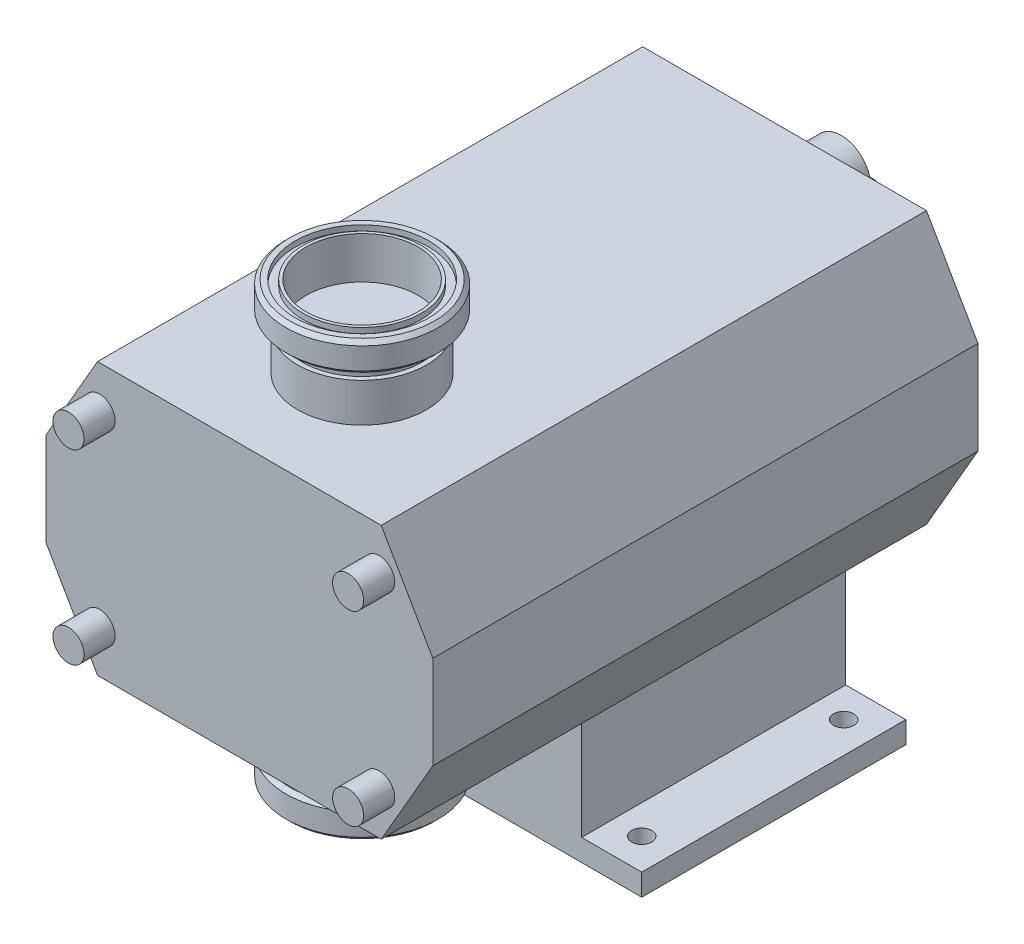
ISO-10303-21;
HEADER;
FILE_DESCRIPTION(('STEP AP214'),'2;1');
FILE_NAME('part.step','',(''),(''),'','','');
FILE_SCHEMA(('AUTOMOTIVE_DESIGN { 1 0 10303 214 1 1 1 1 }'));
ENDSEC;
DATA;
#1=APPLICATION_CONTEXT('core data for automotive mechanical design processes');
#2=APPLICATION_PROTOCOL_DEFINITION('international standard','automotive_design',2000,#1);
#3=PRODUCT_CONTEXT('',#1,'mechanical');
#4=PRODUCT('Part','Part','',(#3));
#5=PRODUCT_RELATED_PRODUCT_CATEGORY('part','',(#4));
#6=PRODUCT_DEFINITION_FORMATION('','',#4);
#7=PRODUCT_DEFINITION_CONTEXT('part definition',#1,'design');
#8=PRODUCT_DEFINITION('design','',#6,#7);
#9=PRODUCT_DEFINITION_SHAPE('','',#8);
#10=(LENGTH_UNIT() NAMED_UNIT(*) SI_UNIT(.MILLI.,.METRE.));
#11=(NAMED_UNIT(*) PLANE_ANGLE_UNIT() SI_UNIT($,.RADIAN.));
#12=(NAMED_UNIT(*) SI_UNIT($,.STERADIAN.) SOLID_ANGLE_UNIT());
#13=UNCERTAINTY_MEASURE_WITH_UNIT(LENGTH_MEASURE(1.E-05),#10,'distance_accuracy_value','');
#14=(GEOMETRIC_REPRESENTATION_CONTEXT(3) GLOBAL_UNCERTAINTY_ASSIGNED_CONTEXT((#13)) GLOBAL_UNIT_ASSIGNED_CONTEXT((#10,
#11,#12)) REPRESENTATION_CONTEXT('',''));
#15=CARTESIAN_POINT('',(0.,0.,0.));
#16=DIRECTION('',(0.,0.,1.));
#17=DIRECTION('',(1.,0.,0.));
#18=AXIS2_PLACEMENT_3D('',#15,#16,#17);
#19=CARTESIAN_POINT('',(38.,136.,272.));
#20=DIRECTION('',(0.,1.,0.));
#21=DIRECTION('',(0.,0.,1.));
#22=AXIS2_PLACEMENT_3D('',#19,#20,#21);
#23=PLANE('',#22);
#24=CARTESIAN_POINT('',(0.,136.,272.));
#25=DIRECTION('',(0.,-1.,0.));
#26=DIRECTION('',(0.,0.,-1.));
#27=AXIS2_PLACEMENT_3D('',#24,#25,#26);
#28=CIRCLE('',#27,38.);
#29=CARTESIAN_POINT('',(0.,136.,234.));
#30=VERTEX_POINT('',#29);
#31=EDGE_CURVE('P0_E57',#30,#30,#28,.T.);
#32=ORIENTED_EDGE('',*,*,#31,.T.);
#33=EDGE_LOOP('',(#32));
#34=FACE_BOUND('',#33,.T.);
#35=CARTESIAN_POINT('',(0.,136.,272.));
#36=DIRECTION('',(0.,-1.,0.));
#37=DIRECTION('',(0.,0.,-1.));
#38=AXIS2_PLACEMENT_3D('',#35,#36,#37);
#39=CIRCLE('',#38,43.);
#40=CARTESIAN_POINT('',(0.,136.,229.));
#41=VERTEX_POINT('',#40);
#42=EDGE_CURVE('P0_E9',#41,#41,#39,.T.);
#43=ORIENTED_EDGE('',*,*,#42,.F.);
#44=EDGE_LOOP('',(#43));
#45=FACE_BOUND('',#44,.T.);
#46=ADVANCED_FACE('P0_F14',(#34,#45),#23,.T.);
#47=CARTESIAN_POINT('',(0.,112.5,272.));
#48=DIRECTION('',(0.,-1.,0.));
#49=DIRECTION('',(0.,0.,-1.));
#50=AXIS2_PLACEMENT_3D('',#47,#48,#49);
#51=CYLINDRICAL_SURFACE('',#50,43.);
#52=ORIENTED_EDGE('',*,*,#42,.T.);
#53=EDGE_LOOP('',(#52));
#54=FACE_BOUND('',#53,.T.);
#55=CARTESIAN_POINT('',(0.,139.5,272.));
#56=DIRECTION('',(0.,-1.,0.));
#57=DIRECTION('',(0.,0.,-1.));
#58=AXIS2_PLACEMENT_3D('',#55,#56,#57);
#59=CIRCLE('',#58,43.);
#60=CARTESIAN_POINT('',(0.,139.5,229.));
#61=VERTEX_POINT('',#60);
#62=EDGE_CURVE('P0_E20',#61,#61,#59,.T.);
#63=ORIENTED_EDGE('',*,*,#62,.F.);
#64=EDGE_LOOP('',(#63));
#65=FACE_BOUND('',#64,.T.);
#66=ADVANCED_FACE('P0_F76',(#54,#65),#51,.F.);
#67=CARTESIAN_POINT('',(43.,139.5,272.));
#68=DIRECTION('',(0.,1.,0.));
#69=DIRECTION('',(0.,0.,1.));
#70=AXIS2_PLACEMENT_3D('',#67,#68,#69);
#71=PLANE('',#70);
#72=ORIENTED_EDGE('',*,*,#62,.T.);
#73=EDGE_LOOP('',(#72));
#74=FACE_BOUND('',#73,.T.);
#75=CARTESIAN_POINT('',(0.,139.5,272.));
#76=DIRECTION('',(0.,-1.,0.));
#77=DIRECTION('',(0.,0.,-1.));
#78=AXIS2_PLACEMENT_3D('',#75,#76,#77);
#79=CIRCLE('',#78,46.5);
#80=CARTESIAN_POINT('',(0.,139.5,225.5));
#81=VERTEX_POINT('',#80);
#82=EDGE_CURVE('P0_E24',#81,#81,#79,.T.);
#83=ORIENTED_EDGE('',*,*,#82,.F.);
#84=EDGE_LOOP('',(#83));
#85=FACE_BOUND('',#84,.T.);
#86=ADVANCED_FACE('P0_F80',(#74,#85),#71,.T.);
#87=CARTESIAN_POINT('',(0.,137.,272.));
#88=DIRECTION('',(0.,-1.,0.));
#89=DIRECTION('',(0.,0.,-1.));
#90=AXIS2_PLACEMENT_3D('',#87,#88,#89);
#91=CONICAL_SURFACE('',#90,49.,0.785398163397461);
#92=ORIENTED_EDGE('',*,*,#82,.T.);
#93=EDGE_LOOP('',(#92));
#94=FACE_BOUND('',#93,.T.);
#95=CARTESIAN_POINT('',(0.,137.,272.));
#96=DIRECTION('',(0.,-1.,0.));
#97=DIRECTION('',(0.,0.,-1.));
#98=AXIS2_PLACEMENT_3D('',#95,#96,#97);
#99=CIRCLE('',#98,49.);
#100=CARTESIAN_POINT('',(0.,137.,223.));
#101=VERTEX_POINT('',#100);
#102=EDGE_CURVE('P0_E28',#101,#101,#99,.T.);
#103=ORIENTED_EDGE('',*,*,#102,.F.);
#104=EDGE_LOOP('',(#103));
#105=FACE_BOUND('',#104,.T.);
#106=ADVANCED_FACE('P0_F84',(#94,#105),#91,.T.);
#107=CARTESIAN_POINT('',(0.,112.5,272.));
#108=DIRECTION('',(0.,-1.,0.));
#109=DIRECTION('',(0.,0.,-1.));
#110=AXIS2_PLACEMENT_3D('',#107,#108,#109);
#111=CYLINDRICAL_SURFACE('',#110,49.);
#112=ORIENTED_EDGE('',*,*,#102,.T.);
#113=EDGE_LOOP('',(#112));
#114=FACE_BOUND('',#113,.T.);
#115=CARTESIAN_POINT('',(0.,123.,272.));
#116=DIRECTION('',(0.,-1.,0.));
#117=DIRECTION('',(0.,0.,-1.));
#118=AXIS2_PLACEMENT_3D('',#115,#116,#117);
#119=CIRCLE('',#118,49.);
#120=CARTESIAN_POINT('',(0.,123.,223.));
#121=VERTEX_POINT('',#120);
#122=EDGE_CURVE('P0_E33',#121,#121,#119,.T.);
#123=ORIENTED_EDGE('',*,*,#122,.F.);
#124=EDGE_LOOP('',(#123));
#125=FACE_BOUND('',#124,.T.);
#126=ADVANCED_FACE('P0_F90',(#114,#125),#111,.T.);
#127=CARTESIAN_POINT('',(0.,120.5,272.));
#128=DIRECTION('',(0.,1.,0.));
#129=DIRECTION('',(0.,0.,1.));
#130=AXIS2_PLACEMENT_3D('',#127,#128,#129);
#131=CONICAL_SURFACE('',#130,46.5,0.785398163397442);
#132=ORIENTED_EDGE('',*,*,#122,.T.);
#133=EDGE_LOOP('',(#132));
#134=FACE_BOUND('',#133,.T.);
#135=CARTESIAN_POINT('',(0.,120.5,272.));
#136=DIRECTION('',(0.,-1.,0.));
#137=DIRECTION('',(0.,0.,-1.));
#138=AXIS2_PLACEMENT_3D('',#135,#136,#137);
#139=CIRCLE('',#138,46.5);
#140=CARTESIAN_POINT('',(0.,120.5,225.5));
#141=VERTEX_POINT('',#140);
#142=EDGE_CURVE('P0_E36',#141,#141,#139,.T.);
#143=ORIENTED_EDGE('',*,*,#142,.F.);
#144=EDGE_LOOP('',(#143));
#145=FACE_BOUND('',#144,.T.);
#146=ADVANCED_FACE('P0_F94',(#134,#145),#131,.T.);
#147=CARTESIAN_POINT('',(46.5,120.5,272.));
#148=DIRECTION('',(0.,-1.,0.));
#149=DIRECTION('',(0.,0.,-1.));
#150=AXIS2_PLACEMENT_3D('',#147,#148,#149);
#151=PLANE('',#150);
#152=ORIENTED_EDGE('',*,*,#142,.T.);
#153=EDGE_LOOP('',(#152));
#154=FACE_BOUND('',#153,.T.);
#155=CARTESIAN_POINT('',(0.,120.5,272.));
#156=DIRECTION('',(0.,-1.,0.));
#157=DIRECTION('',(0.,0.,-1.));
#158=AXIS2_PLACEMENT_3D('',#155,#156,#157);
#159=CIRCLE('',#158,41.);
#160=CARTESIAN_POINT('',(0.,120.5,231.));
#161=VERTEX_POINT('',#160);
#162=EDGE_CURVE('P0_E39',#161,#161,#159,.T.);
#163=ORIENTED_EDGE('',*,*,#162,.F.);
#164=EDGE_LOOP('',(#163));
#165=FACE_BOUND('',#164,.T.);
#166=ADVANCED_FACE('P0_F98',(#154,#165),#151,.T.);
#167=CARTESIAN_POINT('',(0.,118.,272.));
#168=DIRECTION('',(0.,-1.,0.));
#169=DIRECTION('',(0.,0.,-1.));
#170=AXIS2_PLACEMENT_3D('',#167,#168,#169);
#171=TOROIDAL_SURFACE('',#170,41.,2.5);
#172=ORIENTED_EDGE('',*,*,#162,.T.);
#173=EDGE_LOOP('',(#172));
#174=FACE_BOUND('',#173,.T.);
#175=CARTESIAN_POINT('',(0.,118.,272.));
#176=DIRECTION('',(0.,-1.,0.));
#177=DIRECTION('',(0.,0.,-1.));
#178=AXIS2_PLACEMENT_3D('',#175,#176,#177);
#179=CIRCLE('',#178,38.5);
#180=CARTESIAN_POINT('',(0.,118.,233.5));
#181=VERTEX_POINT('',#180);
#182=EDGE_CURVE('P0_E42',#181,#181,#179,.T.);
#183=ORIENTED_EDGE('',*,*,#182,.F.);
#184=EDGE_LOOP('',(#183));
#185=FACE_BOUND('',#184,.T.);
#186=ADVANCED_FACE('P0_F102',(#174,#185),#171,.F.);
#187=CARTESIAN_POINT('',(0.,112.5,272.));
#188=DIRECTION('',(0.,-1.,0.));
#189=DIRECTION('',(0.,0.,-1.));
#190=AXIS2_PLACEMENT_3D('',#187,#188,#189);
#191=CYLINDRICAL_SURFACE('',#190,38.5);
#192=ORIENTED_EDGE('',*,*,#182,.T.);
#193=EDGE_LOOP('',(#192));
#194=FACE_BOUND('',#193,.T.);
#195=CARTESIAN_POINT('',(0.,112.5,272.));
#196=DIRECTION('',(0.,-1.,0.));
#197=DIRECTION('',(0.,0.,-1.));
#198=AXIS2_PLACEMENT_3D('',#195,#196,#197);
#199=CIRCLE('',#198,38.5);
#200=CARTESIAN_POINT('',(0.,112.5,233.5));
#201=VERTEX_POINT('',#200);
#202=EDGE_CURVE('P0_E45',#201,#201,#199,.T.);
#203=ORIENTED_EDGE('',*,*,#202,.F.);
#204=EDGE_LOOP('',(#203));
#205=FACE_BOUND('',#204,.T.);
#206=ADVANCED_FACE('P0_F106',(#194,#205),#191,.T.);
#207=CARTESIAN_POINT('',(38.5,112.5,272.));
#208=DIRECTION('',(0.,-1.,0.));
#209=DIRECTION('',(0.,0.,-1.));
#210=AXIS2_PLACEMENT_3D('',#207,#208,#209);
#211=PLANE('',#210);
#212=ORIENTED_EDGE('',*,*,#202,.T.);
#213=EDGE_LOOP('',(#212));
#214=FACE_BOUND('',#213,.T.);
#215=CARTESIAN_POINT('',(0.,112.5,272.));
#216=DIRECTION('',(0.,-1.,0.));
#217=DIRECTION('',(0.,0.,-1.));
#218=AXIS2_PLACEMENT_3D('',#215,#216,#217);
#219=CIRCLE('',#218,36.1);
#220=CARTESIAN_POINT('',(0.,112.5,235.9));
#221=VERTEX_POINT('',#220);
#222=EDGE_CURVE('P0_E48',#221,#221,#219,.T.);
#223=ORIENTED_EDGE('',*,*,#222,.F.);
#224=EDGE_LOOP('',(#223));
#225=FACE_BOUND('',#224,.T.);
#226=ADVANCED_FACE('P0_F110',(#214,#225),#211,.T.);
#227=CARTESIAN_POINT('',(0.,112.5,272.));
#228=DIRECTION('',(0.,-1.,0.));
#229=DIRECTION('',(0.,0.,-1.));
#230=AXIS2_PLACEMENT_3D('',#227,#228,#229);
#231=CYLINDRICAL_SURFACE('',#230,36.1);
#232=ORIENTED_EDGE('',*,*,#222,.T.);
#233=EDGE_LOOP('',(#232));
#234=FACE_BOUND('',#233,.T.);
#235=CARTESIAN_POINT('',(0.,139.5,272.));
#236=DIRECTION('',(0.,-1.,0.));
#237=DIRECTION('',(0.,0.,-1.));
#238=AXIS2_PLACEMENT_3D('',#235,#236,#237);
#239=CIRCLE('',#238,36.1);
#240=CARTESIAN_POINT('',(0.,139.5,235.9));
#241=VERTEX_POINT('',#240);
#242=EDGE_CURVE('P0_E51',#241,#241,#239,.T.);
#243=ORIENTED_EDGE('',*,*,#242,.F.);
#244=EDGE_LOOP('',(#243));
#245=FACE_BOUND('',#244,.T.);
#246=ADVANCED_FACE('P0_F72',(#234,#245),#231,.F.);
#247=CARTESIAN_POINT('',(36.1000000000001,139.5,272.));
#248=DIRECTION('',(0.,1.,0.));
#249=DIRECTION('',(0.,0.,1.));
#250=AXIS2_PLACEMENT_3D('',#247,#248,#249);
#251=PLANE('',#250);
#252=ORIENTED_EDGE('',*,*,#242,.T.);
#253=EDGE_LOOP('',(#252));
#254=FACE_BOUND('',#253,.T.);
#255=CARTESIAN_POINT('',(0.,139.5,272.));
#256=DIRECTION('',(0.,-1.,0.));
#257=DIRECTION('',(0.,0.,-1.));
#258=AXIS2_PLACEMENT_3D('',#255,#256,#257);
#259=CIRCLE('',#258,38.);
#260=CARTESIAN_POINT('',(0.,139.5,234.));
#261=VERTEX_POINT('',#260);
#262=EDGE_CURVE('P0_E54',#261,#261,#259,.T.);
#263=ORIENTED_EDGE('',*,*,#262,.F.);
#264=EDGE_LOOP('',(#263));
#265=FACE_BOUND('',#264,.T.);
#266=ADVANCED_FACE('P0_F65',(#254,#265),#251,.T.);
#267=CARTESIAN_POINT('',(0.,112.5,272.));
#268=DIRECTION('',(0.,-1.,0.));
#269=DIRECTION('',(0.,0.,-1.));
#270=AXIS2_PLACEMENT_3D('',#267,#268,#269);
#271=CYLINDRICAL_SURFACE('',#270,38.);
#272=ORIENTED_EDGE('',*,*,#262,.T.);
#273=EDGE_LOOP('',(#272));
#274=FACE_BOUND('',#273,.T.);
#275=ORIENTED_EDGE('',*,*,#31,.F.);
#276=EDGE_LOOP('',(#275));
#277=FACE_BOUND('',#276,.T.);
#278=ADVANCED_FACE('P0_F63',(#274,#277),#271,.T.);
#279=CLOSED_SHELL('',(#46,#66,#86,#106,#126,#146,#166,#186,#206,#226,#246,#266,#278));
#280=MANIFOLD_SOLID_BREP('P0_B1',#279);
#281=CARTESIAN_POINT('',(-46.5,0.,241.732657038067));
#282=DIRECTION('',(0.,0.,1.));
#283=DIRECTION('',(1.,0.,0.));
#284=AXIS2_PLACEMENT_3D('',#281,#282,#283);
#285=CYLINDRICAL_SURFACE('',#284,19.);
#286=CARTESIAN_POINT('',(-46.5,0.,-3.));
#287=DIRECTION('',(0.,0.,1.));
#288=DIRECTION('',(1.,0.,0.));
#289=AXIS2_PLACEMENT_3D('',#286,#287,#288);
#290=CIRCLE('',#289,19.);
#291=CARTESIAN_POINT('',(-27.5,0.,-3.));
#292=VERTEX_POINT('',#291);
#293=EDGE_CURVE('P1_E277',#292,#292,#290,.T.);
#294=ORIENTED_EDGE('',*,*,#293,.F.);
#295=EDGE_LOOP('',(#294));
#296=FACE_BOUND('',#295,.T.);
#297=DIRECTION('',(0.,0.,1.));
#298=VECTOR('',#297,1.);
#299=CARTESIAN_POINT('',(-28.1696972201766,4.99999999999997,241.732657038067));
#300=LINE('',#299,#298);
#301=CARTESIAN_POINT('',(-28.1696972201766,5.,-83.));
#302=VERTEX_POINT('',#301);
#303=CARTESIAN_POINT('',(-28.1696972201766,5.,-43.));
#304=VERTEX_POINT('',#303);
#305=EDGE_CURVE('P1_E178',#302,#304,#300,.T.);
#306=ORIENTED_EDGE('',*,*,#305,.F.);
#307=CARTESIAN_POINT('',(-46.5,0.,-83.));
#308=DIRECTION('',(0.,0.,1.));
#309=DIRECTION('',(1.,0.,0.));
#310=AXIS2_PLACEMENT_3D('',#307,#308,#309);
#311=CIRCLE('',#310,19.);
#312=CARTESIAN_POINT('',(-28.1696972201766,-5.,-83.));
#313=VERTEX_POINT('',#312);
#314=EDGE_CURVE('P1_E176',#302,#313,#311,.T.);
#315=ORIENTED_EDGE('',*,*,#314,.T.);
#316=DIRECTION('',(0.,0.,1.));
#317=VECTOR('',#316,1.);
#318=CARTESIAN_POINT('',(-28.1696972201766,-5.00000000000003,241.732657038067));
#319=LINE('',#318,#317);
#320=CARTESIAN_POINT('',(-28.1696972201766,-5.00000000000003,-43.));
#321=VERTEX_POINT('',#320);
#322=EDGE_CURVE('P1_E39',#321,#313,#319,.F.);
#323=ORIENTED_EDGE('',*,*,#322,.F.);
#324=CARTESIAN_POINT('',(-27.5,0.,-48.));
#325=CARTESIAN_POINT('',(-27.5000042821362,0.275769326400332,-47.9999931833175));
#326=CARTESIAN_POINT('',(-27.5060630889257,0.551612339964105,-47.9771088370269));
#327=CARTESIAN_POINT('',(-27.5296447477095,1.09536084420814,-47.8863327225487));
#328=CARTESIAN_POINT('',(-27.5471733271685,1.36326229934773,-47.8184184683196));
#329=CARTESIAN_POINT('',(-27.5917584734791,1.88319959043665,-47.6399368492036));
#330=CARTESIAN_POINT('',(-27.6188029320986,2.13525511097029,-47.5294236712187));
#331=CARTESIAN_POINT('',(-27.6795569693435,2.61725305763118,-47.2690799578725));
#332=CARTESIAN_POINT('',(-27.7132669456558,2.84719416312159,-47.1192470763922));
#333=CARTESIAN_POINT('',(-27.7845611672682,3.28363987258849,-46.7809367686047));
#334=CARTESIAN_POINT('',(-27.8222102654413,3.48957269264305,-46.591735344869));
#335=CARTESIAN_POINT('',(-27.8967199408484,3.86718169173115,-46.1816068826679));
#336=CARTESIAN_POINT('',(-27.9335804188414,4.03885358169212,-45.9606758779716));
#337=CARTESIAN_POINT('',(-28.0030006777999,4.34583417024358,-45.4888224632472));
#338=CARTESIAN_POINT('',(-28.0354785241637,4.48048899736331,-45.237461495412));
#339=CARTESIAN_POINT('',(-28.0915043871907,4.7054029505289,-44.7146757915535));
#340=CARTESIAN_POINT('',(-28.1150540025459,4.79567002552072,-44.4432546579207));
#341=CARTESIAN_POINT('',(-28.1498881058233,4.92726790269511,-43.8943761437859));
#342=CARTESIAN_POINT('',(-28.1614315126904,4.96963355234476,-43.6171837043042));
#343=CARTESIAN_POINT('',(-28.171720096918,5.00745164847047,-43.0594039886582));
#344=CARTESIAN_POINT('',(-28.1704675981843,5.00291261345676,-42.7788173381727));
#345=CARTESIAN_POINT('',(-28.1555378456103,4.9478726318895,-42.2302595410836));
#346=CARTESIAN_POINT('',(-28.1421979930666,4.89861973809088,-41.9621525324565));
#347=CARTESIAN_POINT('',(-28.1051362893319,4.75754734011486,-41.4381479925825));
#348=CARTESIAN_POINT('',(-28.0814136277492,4.6657245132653,-41.1822514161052));
#349=CARTESIAN_POINT('',(-28.0259597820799,4.4410917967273,-40.6866584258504));
#350=CARTESIAN_POINT('',(-27.9941431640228,4.30784106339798,-40.4471717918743));
#351=CARTESIAN_POINT('',(-27.926132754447,4.00444274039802,-39.9935172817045));
#352=CARTESIAN_POINT('',(-27.8899381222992,3.83428805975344,-39.7793542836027));
#353=CARTESIAN_POINT('',(-27.8158419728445,3.45551254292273,-39.3752910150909));
#354=CARTESIAN_POINT('',(-27.7779227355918,3.24584253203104,-39.1863761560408));
#355=CARTESIAN_POINT('',(-27.705680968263,2.79733618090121,-38.8461906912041));
#356=CARTESIAN_POINT('',(-27.671358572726,2.55849875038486,-38.6949214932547));
#357=CARTESIAN_POINT('',(-27.6099756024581,2.05693717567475,-38.4339031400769));
#358=CARTESIAN_POINT('',(-27.5829456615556,1.79411828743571,-38.3243283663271));
#359=CARTESIAN_POINT('',(-27.5394148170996,1.25291705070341,-38.151199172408));
#360=CARTESIAN_POINT('',(-27.5229116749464,0.974538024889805,-38.0876349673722));
#361=CARTESIAN_POINT('',(-27.5026308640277,0.418531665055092,-38.009869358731));
#362=CARTESIAN_POINT('',(-27.4985077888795,0.141104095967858,-37.9943277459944));
#363=CARTESIAN_POINT('',(-27.5024606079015,-0.41239217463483,-38.0093527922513));
#364=CARTESIAN_POINT('',(-27.5105352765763,-0.688461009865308,-38.0399148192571));
#365=CARTESIAN_POINT('',(-27.5377535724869,-1.22664703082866,-38.1451790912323));
#366=CARTESIAN_POINT('',(-27.5567105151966,-1.48892004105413,-38.2191373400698));
#367=CARTESIAN_POINT('',(-27.6035461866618,-1.99731390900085,-38.4082337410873));
#368=CARTESIAN_POINT('',(-27.6314258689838,-2.24343303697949,-38.5233762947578));
#369=CARTESIAN_POINT('',(-27.6938277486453,-2.71776721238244,-38.7940826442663));
#370=CARTESIAN_POINT('',(-27.7284672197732,-2.94554769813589,-38.9503801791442));
#371=CARTESIAN_POINT('',(-27.8003827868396,-3.3721194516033,-39.298034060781));
#372=CARTESIAN_POINT('',(-27.8376593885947,-3.5709051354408,-39.4893971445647));
#373=CARTESIAN_POINT('',(-27.9119129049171,-3.93946537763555,-39.9079980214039));
#374=CARTESIAN_POINT('',(-27.9488536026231,-4.10829545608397,-40.1360753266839));
#375=CARTESIAN_POINT('',(-28.0171260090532,-4.40530154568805,-40.6181009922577));
#376=CARTESIAN_POINT('',(-28.048457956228,-4.5334792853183,-40.8720482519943));
#377=CARTESIAN_POINT('',(-28.1016076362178,-4.74457728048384,-41.3973124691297));
#378=CARTESIAN_POINT('',(-28.1234807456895,-4.82776168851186,-41.6685173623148));
#379=CARTESIAN_POINT('',(-28.1552579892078,-4.94715371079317,-42.2217364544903));
#380=CARTESIAN_POINT('',(-28.1651650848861,-4.98337294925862,-42.5037479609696));
#381=CARTESIAN_POINT('',(-28.1716457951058,-5.00715081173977,-43.0609183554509));
#382=CARTESIAN_POINT('',(-28.1686348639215,-4.99622557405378,-43.3360086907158));
#383=CARTESIAN_POINT('',(-28.1505888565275,-4.92953140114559,-43.8802760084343));
#384=CARTESIAN_POINT('',(-28.1355540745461,-4.87376356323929,-44.1494531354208));
#385=CARTESIAN_POINT('',(-28.095398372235,-4.71983552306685,-44.6724009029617));
#386=CARTESIAN_POINT('',(-28.0703520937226,-4.6219886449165,-44.9262699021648));
#387=CARTESIAN_POINT('',(-28.012991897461,-4.38692411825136,-45.4141783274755));
#388=CARTESIAN_POINT('',(-27.9806768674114,-4.24970044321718,-45.648214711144));
#389=CARTESIAN_POINT('',(-27.9112611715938,-3.93514861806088,-46.0970708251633));
#390=CARTESIAN_POINT('',(-27.8740497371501,-3.7567820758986,-46.3111458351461));
#391=CARTESIAN_POINT('',(-27.7996615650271,-3.36699304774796,-46.7068188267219));
#392=CARTESIAN_POINT('',(-27.7624848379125,-3.15556257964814,-46.8884089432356));
#393=CARTESIAN_POINT('',(-27.6914364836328,-2.7003741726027,-47.2176404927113));
#394=CARTESIAN_POINT('',(-27.6576490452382,-2.45603841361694,-47.3645027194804));
#395=CARTESIAN_POINT('',(-27.5980996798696,-1.94526775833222,-47.6148349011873));
#396=CARTESIAN_POINT('',(-27.5723324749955,-1.67884754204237,-47.7183334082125));
#397=CARTESIAN_POINT('',(-27.5351625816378,-1.17775159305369,-47.8650961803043));
#398=CARTESIAN_POINT('',(-27.5220714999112,-0.94528670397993,-47.9155694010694));
#399=CARTESIAN_POINT('',(-27.5044887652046,-0.475232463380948,-47.9830226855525));
#400=CARTESIAN_POINT('',(-27.4999963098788,-0.237643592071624,-48.0000058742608));
#401=CARTESIAN_POINT('',(-27.5,0.,-48.));
#402=B_SPLINE_CURVE_WITH_KNOTS('',3,(#324,#325,#326,#327,#328,#329,#330,#331,#332,#333,#334,
#335,#336,#337,#338,#339,#340,#341,#342,#343,#344,#345,#346,#347,#348,#349,#350,#351,#352,#353,
#354,#355,#356,#357,#358,#359,#360,#361,#362,#363,#364,#365,#366,#367,#368,#369,#370,#371,#372,
#373,#374,#375,#376,#377,#378,#379,#380,#381,#382,#383,#384,#385,#386,#387,#388,#389,#390,#391,
#392,#393,#394,#395,#396,#397,#398,#399,#400,#401),.UNSPECIFIED.,.T.,.F.,(4,2,2,2,2,2,2,2,2,2,2,
2,2,2,2,2,2,2,2,2,2,2,2,2,2,2,2,2,2,2,2,2,2,2,2,2,2,2,4),(0.,0.826436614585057,1.65328622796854,
2.47908752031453,3.30493809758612,4.14758534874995,4.99033802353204,5.84713921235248,
6.70378690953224,7.54155141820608,8.37916378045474,9.19409222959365,10.0090842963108,
10.8330642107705,11.6572025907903,12.5074895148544,13.35780823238,14.2116451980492,
15.0653005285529,15.8949065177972,16.7244291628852,17.5401294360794,18.3559169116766,
19.187369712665,20.0189824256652,20.873388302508,21.7277578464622,22.577055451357,
23.4261428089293,24.2481310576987,25.0700991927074,25.8860500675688,26.702125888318,
27.5416338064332,28.3813447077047,29.2384104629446,30.0949110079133,30.8071573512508,
31.5193372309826),.UNSPECIFIED.);
#403=EDGE_CURVE('P1_E11',#304,#321,#402,.T.);
#404=ORIENTED_EDGE('',*,*,#403,.F.);
#405=EDGE_LOOP('',(#306,#315,#323,#404));
#406=FACE_BOUND('',#405,.T.);
#407=ADVANCED_FACE('P1_F17',(#296,#406),#285,.T.);
#408=CARTESIAN_POINT('',(-91.3023595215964,-87.5,351.));
#409=DIRECTION('',(0.,1.,0.));
#410=DIRECTION('',(-1.,0.,0.));
#411=AXIS2_PLACEMENT_3D('',#408,#409,#410);
#412=PLANE('',#411);
#413=CARTESIAN_POINT('',(0.,-87.5,272.));
#414=DIRECTION('',(0.,1.,0.));
#415=DIRECTION('',(-1.,0.,0.));
#416=AXIS2_PLACEMENT_3D('',#413,#414,#415);
#417=CIRCLE('',#416,41.5);
#418=CARTESIAN_POINT('',(-41.4999999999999,-87.5,272.));
#419=VERTEX_POINT('',#418);
#420=EDGE_CURVE('P1_E192',#419,#419,#417,.T.);
#421=ORIENTED_EDGE('',*,*,#420,.T.);
#422=EDGE_LOOP('',(#421));
#423=FACE_BOUND('',#422,.T.);
#424=DIRECTION('',(1.,0.,0.));
#425=VECTOR('',#424,1.);
#426=CARTESIAN_POINT('',(-91.3023595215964,-87.5,0.));
#427=LINE('',#426,#425);
#428=CARTESIAN_POINT('',(-91.3023595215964,-87.5,0.));
#429=VERTEX_POINT('',#428);
#430=CARTESIAN_POINT('',(91.3023595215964,-87.5,0.));
#431=VERTEX_POINT('',#430);
#432=EDGE_CURVE('P1_E337',#429,#431,#427,.T.);
#433=ORIENTED_EDGE('',*,*,#432,.T.);
#434=DIRECTION('',(0.,0.,-1.));
#435=VECTOR('',#434,1.);
#436=CARTESIAN_POINT('',(91.3023595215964,-87.5,351.));
#437=LINE('',#436,#435);
#438=CARTESIAN_POINT('',(91.3023595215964,-87.5,351.));
#439=VERTEX_POINT('',#438);
#440=EDGE_CURVE('P1_E347',#439,#431,#437,.T.);
#441=ORIENTED_EDGE('',*,*,#440,.F.);
#442=DIRECTION('',(1.,0.,0.));
#443=VECTOR('',#442,1.);
#444=CARTESIAN_POINT('',(-91.3023595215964,-87.5,351.));
#445=LINE('',#444,#443);
#446=CARTESIAN_POINT('',(-91.3023595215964,-87.5,351.));
#447=VERTEX_POINT('',#446);
#448=EDGE_CURVE('P1_E320',#447,#439,#445,.T.);
#449=ORIENTED_EDGE('',*,*,#448,.F.);
#450=DIRECTION('',(0.,0.,-1.));
#451=VECTOR('',#450,1.);
#452=CARTESIAN_POINT('',(-91.3023595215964,-87.5,351.));
#453=LINE('',#452,#451);
#454=EDGE_CURVE('P1_E350',#447,#429,#453,.T.);
#455=ORIENTED_EDGE('',*,*,#454,.T.);
#456=EDGE_LOOP('',(#433,#441,#449,#455));
#457=FACE_BOUND('',#456,.T.);
#458=DIRECTION('',(1.,0.,0.));
#459=VECTOR('',#458,1.);
#460=CARTESIAN_POINT('',(66.3023595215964,-87.5,27.));
#461=LINE('',#460,#459);
#462=CARTESIAN_POINT('',(-66.3023595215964,-87.5,27.));
#463=VERTEX_POINT('',#462);
#464=CARTESIAN_POINT('',(66.3023595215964,-87.5,27.));
#465=VERTEX_POINT('',#464);
#466=EDGE_CURVE('P1_E220',#463,#465,#461,.T.);
#467=ORIENTED_EDGE('',*,*,#466,.F.);
#468=DIRECTION('',(0.,0.,1.));
#469=VECTOR('',#468,1.);
#470=CARTESIAN_POINT('',(-66.3023595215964,-87.5,27.));
#471=LINE('',#470,#469);
#472=CARTESIAN_POINT('',(-66.3023595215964,-87.5,197.));
#473=VERTEX_POINT('',#472);
#474=EDGE_CURVE('P1_E238',#463,#473,#471,.T.);
#475=ORIENTED_EDGE('',*,*,#474,.T.);
#476=DIRECTION('',(1.,0.,0.));
#477=VECTOR('',#476,1.);
#478=CARTESIAN_POINT('',(66.3023595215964,-87.5,197.));
#479=LINE('',#478,#477);
#480=CARTESIAN_POINT('',(66.3023595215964,-87.5,197.));
#481=VERTEX_POINT('',#480);
#482=EDGE_CURVE('P1_E219',#473,#481,#479,.T.);
#483=ORIENTED_EDGE('',*,*,#482,.T.);
#484=DIRECTION('',(0.,0.,1.));
#485=VECTOR('',#484,1.);
#486=CARTESIAN_POINT('',(66.3023595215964,-87.5,27.));
#487=LINE('',#486,#485);
#488=EDGE_CURVE('P1_E274',#465,#481,#487,.T.);
#489=ORIENTED_EDGE('',*,*,#488,.F.);
#490=EDGE_LOOP('',(#467,#475,#483,#489));
#491=FACE_BOUND('',#490,.T.);
#492=ADVANCED_FACE('P1_F393',(#423,#457,#491),#412,.F.);
#493=CARTESIAN_POINT('',(141.820508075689,0.,0.));
#494=DIRECTION('',(0.,0.,1.));
#495=DIRECTION('',(1.,0.,0.));
#496=AXIS2_PLACEMENT_3D('',#493,#494,#495);
#497=PLANE('',#496);
#498=DIRECTION('',(-0.500000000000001,0.866025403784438,0.));
#499=VECTOR('',#498,1.);
#500=CARTESIAN_POINT('',(91.3023595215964,87.5,0.));
#501=LINE('',#500,#499);
#502=CARTESIAN_POINT('',(124.5,30.,0.));
#503=VERTEX_POINT('',#502);
#504=CARTESIAN_POINT('',(91.3023595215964,87.5,0.));
#505=VERTEX_POINT('',#504);
#506=EDGE_CURVE('P1_E305',#503,#505,#501,.T.);
#507=ORIENTED_EDGE('',*,*,#506,.F.);
#508=DIRECTION('',(0.,1.,0.));
#509=VECTOR('',#508,1.);
#510=CARTESIAN_POINT('',(124.5,30.,0.));
#511=LINE('',#510,#509);
#512=CARTESIAN_POINT('',(124.5,-30.,0.));
#513=VERTEX_POINT('',#512);
#514=EDGE_CURVE('P1_E312',#513,#503,#511,.T.);
#515=ORIENTED_EDGE('',*,*,#514,.F.);
#516=DIRECTION('',(0.500000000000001,0.866025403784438,0.));
#517=VECTOR('',#516,1.);
#518=CARTESIAN_POINT('',(91.3023595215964,-87.5,0.));
#519=LINE('',#518,#517);
#520=EDGE_CURVE('P1_E339',#431,#513,#519,.T.);
#521=ORIENTED_EDGE('',*,*,#520,.F.);
#522=ORIENTED_EDGE('',*,*,#432,.F.);
#523=DIRECTION('',(0.500000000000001,-0.866025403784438,0.));
#524=VECTOR('',#523,1.);
#525=CARTESIAN_POINT('',(-91.3023595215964,-87.5,0.));
#526=LINE('',#525,#524);
#527=CARTESIAN_POINT('',(-124.5,-30.,0.));
#528=VERTEX_POINT('',#527);
#529=EDGE_CURVE('P1_E335',#528,#429,#526,.T.);
#530=ORIENTED_EDGE('',*,*,#529,.F.);
#531=DIRECTION('',(0.,-1.,0.));
#532=VECTOR('',#531,1.);
#533=CARTESIAN_POINT('',(-124.5,30.,0.));
#534=LINE('',#533,#532);
#535=CARTESIAN_POINT('',(-124.5,30.,0.));
#536=VERTEX_POINT('',#535);
#537=EDGE_CURVE('P1_E333',#536,#528,#534,.T.);
#538=ORIENTED_EDGE('',*,*,#537,.F.);
#539=DIRECTION('',(-0.500000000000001,-0.866025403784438,0.));
#540=VECTOR('',#539,1.);
#541=CARTESIAN_POINT('',(-91.3023595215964,87.5,0.));
#542=LINE('',#541,#540);
#543=CARTESIAN_POINT('',(-91.3023595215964,87.5,0.));
#544=VERTEX_POINT('',#543);
#545=EDGE_CURVE('P1_E331',#544,#536,#542,.T.);
#546=ORIENTED_EDGE('',*,*,#545,.F.);
#547=DIRECTION('',(-1.,0.,0.));
#548=VECTOR('',#547,1.);
#549=CARTESIAN_POINT('',(-91.3023595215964,87.5,0.));
#550=LINE('',#549,#548);
#551=EDGE_CURVE('P1_E329',#505,#544,#550,.T.);
#552=ORIENTED_EDGE('',*,*,#551,.F.);
#553=EDGE_LOOP('',(#507,#515,#521,#522,#530,#538,#546,#552));
#554=FACE_BOUND('',#553,.T.);
#555=CARTESIAN_POINT('',(-46.5,0.,0.));
#556=DIRECTION('',(0.,0.,1.));
#557=DIRECTION('',(1.,0.,0.));
#558=AXIS2_PLACEMENT_3D('',#555,#556,#557);
#559=CIRCLE('',#558,22.);
#560=CARTESIAN_POINT('',(-24.5,0.,0.));
#561=VERTEX_POINT('',#560);
#562=EDGE_CURVE('P1_E29',#561,#561,#559,.F.);
#563=ORIENTED_EDGE('',*,*,#562,.F.);
#564=EDGE_LOOP('',(#563));
#565=FACE_BOUND('',#564,.T.);
#566=ADVANCED_FACE('P1_F399',(#554,#565),#497,.F.);
#567=CARTESIAN_POINT('',(141.820508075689,0.,351.));
#568=DIRECTION('',(0.,0.,1.));
#569=DIRECTION('',(1.,0.,0.));
#570=AXIS2_PLACEMENT_3D('',#567,#568,#569);
#571=PLANE('',#570);
#572=CARTESIAN_POINT('',(90.,-60.,351.));
#573=DIRECTION('',(0.,0.,1.));
#574=DIRECTION('',(1.,0.,0.));
#575=AXIS2_PLACEMENT_3D('',#572,#573,#574);
#576=CIRCLE('',#575,9.99999999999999);
#577=CARTESIAN_POINT('',(100.,-60.,351.));
#578=VERTEX_POINT('',#577);
#579=EDGE_CURVE('P1_E287',#578,#578,#576,.T.);
#580=ORIENTED_EDGE('',*,*,#579,.F.);
#581=EDGE_LOOP('',(#580));
#582=FACE_BOUND('',#581,.T.);
#583=CARTESIAN_POINT('',(-90.,60.,351.));
#584=DIRECTION('',(0.,0.,1.));
#585=DIRECTION('',(1.,0.,0.));
#586=AXIS2_PLACEMENT_3D('',#583,#584,#585);
#587=CIRCLE('',#586,9.99999999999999);
#588=CARTESIAN_POINT('',(-80.,60.,351.));
#589=VERTEX_POINT('',#588);
#590=EDGE_CURVE('P1_E299',#589,#589,#587,.T.);
#591=ORIENTED_EDGE('',*,*,#590,.F.);
#592=EDGE_LOOP('',(#591));
#593=FACE_BOUND('',#592,.T.);
#594=DIRECTION('',(-0.500000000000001,0.866025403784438,0.));
#595=VECTOR('',#594,1.);
#596=CARTESIAN_POINT('',(91.3023595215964,87.5,351.));
#597=LINE('',#596,#595);
#598=CARTESIAN_POINT('',(124.5,30.,351.));
#599=VERTEX_POINT('',#598);
#600=CARTESIAN_POINT('',(91.3023595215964,87.5,351.));
#601=VERTEX_POINT('',#600);
#602=EDGE_CURVE('P1_E308',#599,#601,#597,.T.);
#603=ORIENTED_EDGE('',*,*,#602,.T.);
#604=DIRECTION('',(-1.,0.,0.));
#605=VECTOR('',#604,1.);
#606=CARTESIAN_POINT('',(-91.3023595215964,87.5,351.));
#607=LINE('',#606,#605);
#608=CARTESIAN_POINT('',(-91.3023595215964,87.5,351.));
#609=VERTEX_POINT('',#608);
#610=EDGE_CURVE('P1_E311',#601,#609,#607,.T.);
#611=ORIENTED_EDGE('',*,*,#610,.T.);
#612=DIRECTION('',(-0.500000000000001,-0.866025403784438,0.));
#613=VECTOR('',#612,1.);
#614=CARTESIAN_POINT('',(-91.3023595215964,87.5,351.));
#615=LINE('',#614,#613);
#616=CARTESIAN_POINT('',(-124.5,30.,351.));
#617=VERTEX_POINT('',#616);
#618=EDGE_CURVE('P1_E314',#609,#617,#615,.T.);
#619=ORIENTED_EDGE('',*,*,#618,.T.);
#620=DIRECTION('',(0.,-1.,0.));
#621=VECTOR('',#620,1.);
#622=CARTESIAN_POINT('',(-124.5,30.,351.));
#623=LINE('',#622,#621);
#624=CARTESIAN_POINT('',(-124.5,-30.,351.));
#625=VERTEX_POINT('',#624);
#626=EDGE_CURVE('P1_E316',#617,#625,#623,.T.);
#627=ORIENTED_EDGE('',*,*,#626,.T.);
#628=DIRECTION('',(0.500000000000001,-0.866025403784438,0.));
#629=VECTOR('',#628,1.);
#630=CARTESIAN_POINT('',(-91.3023595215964,-87.5,351.));
#631=LINE('',#630,#629);
#632=EDGE_CURVE('P1_E318',#625,#447,#631,.T.);
#633=ORIENTED_EDGE('',*,*,#632,.T.);
#634=ORIENTED_EDGE('',*,*,#448,.T.);
#635=DIRECTION('',(0.500000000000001,0.866025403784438,0.));
#636=VECTOR('',#635,1.);
#637=CARTESIAN_POINT('',(91.3023595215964,-87.5,351.));
#638=LINE('',#637,#636);
#639=CARTESIAN_POINT('',(124.5,-30.,351.));
#640=VERTEX_POINT('',#639);
#641=EDGE_CURVE('P1_E322',#439,#640,#638,.T.);
#642=ORIENTED_EDGE('',*,*,#641,.T.);
#643=DIRECTION('',(0.,1.,0.));
#644=VECTOR('',#643,1.);
#645=CARTESIAN_POINT('',(124.5,30.,351.));
#646=LINE('',#645,#644);
#647=EDGE_CURVE('P1_E324',#640,#599,#646,.T.);
#648=ORIENTED_EDGE('',*,*,#647,.T.);
#649=EDGE_LOOP('',(#603,#611,#619,#627,#633,#634,#642,#648));
#650=FACE_BOUND('',#649,.T.);
#651=CARTESIAN_POINT('',(90.,60.,351.));
#652=DIRECTION('',(0.,0.,1.));
#653=DIRECTION('',(1.,0.,0.));
#654=AXIS2_PLACEMENT_3D('',#651,#652,#653);
#655=CIRCLE('',#654,9.99999999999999);
#656=CARTESIAN_POINT('',(100.,60.,351.));
#657=VERTEX_POINT('',#656);
#658=EDGE_CURVE('P1_E293',#657,#657,#655,.T.);
#659=ORIENTED_EDGE('',*,*,#658,.F.);
#660=EDGE_LOOP('',(#659));
#661=FACE_BOUND('',#660,.T.);
#662=CARTESIAN_POINT('',(-90.,-60.,351.));
#663=DIRECTION('',(0.,0.,1.));
#664=DIRECTION('',(1.,0.,0.));
#665=AXIS2_PLACEMENT_3D('',#662,#663,#664);
#666=CIRCLE('',#665,9.99999999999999);
#667=CARTESIAN_POINT('',(-80.,-60.,351.));
#668=VERTEX_POINT('',#667);
#669=EDGE_CURVE('P1_E283',#668,#668,#666,.T.);
#670=ORIENTED_EDGE('',*,*,#669,.F.);
#671=EDGE_LOOP('',(#670));
#672=FACE_BOUND('',#671,.T.);
#673=ADVANCED_FACE('P1_F448',(#582,#593,#650,#661,#672),#571,.T.);
#674=CARTESIAN_POINT('',(91.3023595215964,87.5,351.));
#675=DIRECTION('',(-0.866025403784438,-0.500000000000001,0.));
#676=DIRECTION('',(0.500000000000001,-0.866025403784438,0.));
#677=AXIS2_PLACEMENT_3D('',#674,#675,#676);
#678=PLANE('',#677);
#679=ORIENTED_EDGE('',*,*,#506,.T.);
#680=DIRECTION('',(0.,0.,-1.));
#681=VECTOR('',#680,1.);
#682=CARTESIAN_POINT('',(91.3023595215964,87.5,351.));
#683=LINE('',#682,#681);
#684=EDGE_CURVE('P1_E362',#601,#505,#683,.T.);
#685=ORIENTED_EDGE('',*,*,#684,.F.);
#686=ORIENTED_EDGE('',*,*,#602,.F.);
#687=DIRECTION('',(0.,0.,-1.));
#688=VECTOR('',#687,1.);
#689=CARTESIAN_POINT('',(124.5,30.,351.));
#690=LINE('',#689,#688);
#691=EDGE_CURVE('P1_E326',#599,#503,#690,.T.);
#692=ORIENTED_EDGE('',*,*,#691,.T.);
#693=EDGE_LOOP('',(#679,#685,#686,#692));
#694=FACE_BOUND('',#693,.T.);
#695=ADVANCED_FACE('P1_F19',(#694),#678,.F.);
#696=CARTESIAN_POINT('',(-91.3023595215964,87.5,351.));
#697=DIRECTION('',(0.,-1.,0.));
#698=DIRECTION('',(1.,0.,0.));
#699=AXIS2_PLACEMENT_3D('',#696,#697,#698);
#700=PLANE('',#699);
#701=CARTESIAN_POINT('',(0.,87.5,272.));
#702=DIRECTION('',(0.,-1.,0.));
#703=DIRECTION('',(1.,0.,0.));
#704=AXIS2_PLACEMENT_3D('',#701,#702,#703);
#705=CIRCLE('',#704,41.5);
#706=CARTESIAN_POINT('',(41.5,87.5,272.));
#707=VERTEX_POINT('',#706);
#708=EDGE_CURVE('P1_E191',#707,#707,#705,.T.);
#709=ORIENTED_EDGE('',*,*,#708,.T.);
#710=EDGE_LOOP('',(#709));
#711=FACE_BOUND('',#710,.T.);
#712=ORIENTED_EDGE('',*,*,#551,.T.);
#713=DIRECTION('',(0.,0.,-1.));
#714=VECTOR('',#713,1.);
#715=CARTESIAN_POINT('',(-91.3023595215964,87.5,351.));
#716=LINE('',#715,#714);
#717=EDGE_CURVE('P1_E359',#609,#544,#716,.T.);
#718=ORIENTED_EDGE('',*,*,#717,.F.);
#719=ORIENTED_EDGE('',*,*,#610,.F.);
#720=ORIENTED_EDGE('',*,*,#684,.T.);
#721=EDGE_LOOP('',(#712,#718,#719,#720));
#722=FACE_BOUND('',#721,.T.);
#723=ADVANCED_FACE('P1_F369',(#711,#722),#700,.F.);
#724=CARTESIAN_POINT('',(-91.3023595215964,87.5,351.));
#725=DIRECTION('',(0.866025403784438,-0.500000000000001,0.));
#726=DIRECTION('',(0.500000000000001,0.866025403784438,0.));
#727=AXIS2_PLACEMENT_3D('',#724,#725,#726);
#728=PLANE('',#727);
#729=ORIENTED_EDGE('',*,*,#545,.T.);
#730=DIRECTION('',(0.,0.,-1.));
#731=VECTOR('',#730,1.);
#732=CARTESIAN_POINT('',(-124.5,30.,351.));
#733=LINE('',#732,#731);
#734=EDGE_CURVE('P1_E356',#617,#536,#733,.T.);
#735=ORIENTED_EDGE('',*,*,#734,.F.);
#736=ORIENTED_EDGE('',*,*,#618,.F.);
#737=ORIENTED_EDGE('',*,*,#717,.T.);
#738=EDGE_LOOP('',(#729,#735,#736,#737));
#739=FACE_BOUND('',#738,.T.);
#740=ADVANCED_FACE('P1_F469',(#739),#728,.F.);
#741=CARTESIAN_POINT('',(-124.5,30.,351.));
#742=DIRECTION('',(1.,0.,0.));
#743=DIRECTION('',(0.,0.,-1.));
#744=AXIS2_PLACEMENT_3D('',#741,#742,#743);
#745=PLANE('',#744);
#746=ORIENTED_EDGE('',*,*,#537,.T.);
#747=DIRECTION('',(0.,0.,-1.));
#748=VECTOR('',#747,1.);
#749=CARTESIAN_POINT('',(-124.5,-30.,351.));
#750=LINE('',#749,#748);
#751=EDGE_CURVE('P1_E353',#625,#528,#750,.T.);
#752=ORIENTED_EDGE('',*,*,#751,.F.);
#753=ORIENTED_EDGE('',*,*,#626,.F.);
#754=ORIENTED_EDGE('',*,*,#734,.T.);
#755=EDGE_LOOP('',(#746,#752,#753,#754));
#756=FACE_BOUND('',#755,.T.);
#757=ADVANCED_FACE('P1_F465',(#756),#745,.F.);
#758=CARTESIAN_POINT('',(-91.3023595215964,-87.5,351.));
#759=DIRECTION('',(0.866025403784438,0.500000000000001,0.));
#760=DIRECTION('',(-0.500000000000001,0.866025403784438,0.));
#761=AXIS2_PLACEMENT_3D('',#758,#759,#760);
#762=PLANE('',#761);
#763=ORIENTED_EDGE('',*,*,#529,.T.);
#764=ORIENTED_EDGE('',*,*,#454,.F.);
#765=ORIENTED_EDGE('',*,*,#632,.F.);
#766=ORIENTED_EDGE('',*,*,#751,.T.);
#767=EDGE_LOOP('',(#763,#764,#765,#766));
#768=FACE_BOUND('',#767,.T.);
#769=ADVANCED_FACE('P1_F460',(#768),#762,.F.);
#770=CARTESIAN_POINT('',(91.3023595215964,-87.5,351.));
#771=DIRECTION('',(-0.866025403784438,0.500000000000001,0.));
#772=DIRECTION('',(-0.500000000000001,-0.866025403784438,0.));
#773=AXIS2_PLACEMENT_3D('',#770,#771,#772);
#774=PLANE('',#773);
#775=ORIENTED_EDGE('',*,*,#520,.T.);
#776=DIRECTION('',(0.,0.,-1.));
#777=VECTOR('',#776,1.);
#778=CARTESIAN_POINT('',(124.5,-30.,351.));
#779=LINE('',#778,#777);
#780=EDGE_CURVE('P1_E344',#640,#513,#779,.T.);
#781=ORIENTED_EDGE('',*,*,#780,.F.);
#782=ORIENTED_EDGE('',*,*,#641,.F.);
#783=ORIENTED_EDGE('',*,*,#440,.T.);
#784=EDGE_LOOP('',(#775,#781,#782,#783));
#785=FACE_BOUND('',#784,.T.);
#786=ADVANCED_FACE('P1_F457',(#785),#774,.F.);
#787=CARTESIAN_POINT('',(124.5,30.,351.));
#788=DIRECTION('',(-1.,0.,0.));
#789=DIRECTION('',(0.,0.,1.));
#790=AXIS2_PLACEMENT_3D('',#787,#788,#789);
#791=PLANE('',#790);
#792=ORIENTED_EDGE('',*,*,#514,.T.);
#793=ORIENTED_EDGE('',*,*,#691,.F.);
#794=ORIENTED_EDGE('',*,*,#647,.F.);
#795=ORIENTED_EDGE('',*,*,#780,.T.);
#796=EDGE_LOOP('',(#792,#793,#794,#795));
#797=FACE_BOUND('',#796,.T.);
#798=ADVANCED_FACE('P1_F446',(#797),#791,.F.);
#799=CARTESIAN_POINT('',(-90.,60.,371.));
#800=DIRECTION('',(0.,0.,-1.));
#801=DIRECTION('',(-1.,0.,0.));
#802=AXIS2_PLACEMENT_3D('',#799,#800,#801);
#803=CYLINDRICAL_SURFACE('',#802,9.99999999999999);
#804=CARTESIAN_POINT('',(-90.,60.,371.));
#805=DIRECTION('',(0.,0.,1.));
#806=DIRECTION('',(1.,0.,0.));
#807=AXIS2_PLACEMENT_3D('',#804,#805,#806);
#808=CIRCLE('',#807,9.99999999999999);
#809=CARTESIAN_POINT('',(-80.,60.,371.));
#810=VERTEX_POINT('',#809);
#811=EDGE_CURVE('P1_E302',#810,#810,#808,.T.);
#812=ORIENTED_EDGE('',*,*,#811,.F.);
#813=EDGE_LOOP('',(#812));
#814=FACE_BOUND('',#813,.T.);
#815=ORIENTED_EDGE('',*,*,#590,.T.);
#816=EDGE_LOOP('',(#815));
#817=FACE_BOUND('',#816,.T.);
#818=ADVANCED_FACE('P1_F442',(#814,#817),#803,.T.);
#819=CARTESIAN_POINT('',(-90.,60.,371.));
#820=DIRECTION('',(0.,0.,1.));
#821=DIRECTION('',(1.,0.,0.));
#822=AXIS2_PLACEMENT_3D('',#819,#820,#821);
#823=PLANE('',#822);
#824=ORIENTED_EDGE('',*,*,#811,.T.);
#825=EDGE_LOOP('',(#824));
#826=FACE_BOUND('',#825,.T.);
#827=ADVANCED_FACE('P1_F438',(#826),#823,.T.);
#828=CARTESIAN_POINT('',(90.,60.,371.));
#829=DIRECTION('',(0.,0.,-1.));
#830=DIRECTION('',(-1.,0.,0.));
#831=AXIS2_PLACEMENT_3D('',#828,#829,#830);
#832=CYLINDRICAL_SURFACE('',#831,9.99999999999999);
#833=CARTESIAN_POINT('',(90.,60.,371.));
#834=DIRECTION('',(0.,0.,1.));
#835=DIRECTION('',(1.,0.,0.));
#836=AXIS2_PLACEMENT_3D('',#833,#834,#835);
#837=CIRCLE('',#836,9.99999999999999);
#838=CARTESIAN_POINT('',(100.,60.,371.));
#839=VERTEX_POINT('',#838);
#840=EDGE_CURVE('P1_E296',#839,#839,#837,.T.);
#841=ORIENTED_EDGE('',*,*,#840,.F.);
#842=EDGE_LOOP('',(#841));
#843=FACE_BOUND('',#842,.T.);
#844=ORIENTED_EDGE('',*,*,#658,.T.);
#845=EDGE_LOOP('',(#844));
#846=FACE_BOUND('',#845,.T.);
#847=ADVANCED_FACE('P1_F434',(#843,#846),#832,.T.);
#848=CARTESIAN_POINT('',(90.,60.,371.));
#849=DIRECTION('',(0.,0.,1.));
#850=DIRECTION('',(1.,0.,0.));
#851=AXIS2_PLACEMENT_3D('',#848,#849,#850);
#852=PLANE('',#851);
#853=ORIENTED_EDGE('',*,*,#840,.T.);
#854=EDGE_LOOP('',(#853));
#855=FACE_BOUND('',#854,.T.);
#856=ADVANCED_FACE('P1_F430',(#855),#852,.T.);
#857=CARTESIAN_POINT('',(90.,-60.,371.));
#858=DIRECTION('',(0.,0.,-1.));
#859=DIRECTION('',(-1.,0.,0.));
#860=AXIS2_PLACEMENT_3D('',#857,#858,#859);
#861=CYLINDRICAL_SURFACE('',#860,9.99999999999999);
#862=CARTESIAN_POINT('',(90.,-60.,371.));
#863=DIRECTION('',(0.,0.,1.));
#864=DIRECTION('',(1.,0.,0.));
#865=AXIS2_PLACEMENT_3D('',#862,#863,#864);
#866=CIRCLE('',#865,9.99999999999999);
#867=CARTESIAN_POINT('',(100.,-60.,371.));
#868=VERTEX_POINT('',#867);
#869=EDGE_CURVE('P1_E290',#868,#868,#866,.T.);
#870=ORIENTED_EDGE('',*,*,#869,.F.);
#871=EDGE_LOOP('',(#870));
#872=FACE_BOUND('',#871,.T.);
#873=ORIENTED_EDGE('',*,*,#579,.T.);
#874=EDGE_LOOP('',(#873));
#875=FACE_BOUND('',#874,.T.);
#876=ADVANCED_FACE('P1_F426',(#872,#875),#861,.T.);
#877=CARTESIAN_POINT('',(90.,-60.,371.));
#878=DIRECTION('',(0.,0.,1.));
#879=DIRECTION('',(1.,0.,0.));
#880=AXIS2_PLACEMENT_3D('',#877,#878,#879);
#881=PLANE('',#880);
#882=ORIENTED_EDGE('',*,*,#869,.T.);
#883=EDGE_LOOP('',(#882));
#884=FACE_BOUND('',#883,.T.);
#885=ADVANCED_FACE('P1_F422',(#884),#881,.T.);
#886=CARTESIAN_POINT('',(-90.,-60.,371.));
#887=DIRECTION('',(0.,0.,-1.));
#888=DIRECTION('',(-1.,0.,0.));
#889=AXIS2_PLACEMENT_3D('',#886,#887,#888);
#890=CYLINDRICAL_SURFACE('',#889,9.99999999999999);
#891=CARTESIAN_POINT('',(-90.,-60.,371.));
#892=DIRECTION('',(0.,0.,1.));
#893=DIRECTION('',(1.,0.,0.));
#894=AXIS2_PLACEMENT_3D('',#891,#892,#893);
#895=CIRCLE('',#894,9.99999999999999);
#896=CARTESIAN_POINT('',(-80.,-60.,371.));
#897=VERTEX_POINT('',#896);
#898=EDGE_CURVE('P1_E284',#897,#897,#895,.T.);
#899=ORIENTED_EDGE('',*,*,#898,.F.);
#900=EDGE_LOOP('',(#899));
#901=FACE_BOUND('',#900,.T.);
#902=ORIENTED_EDGE('',*,*,#669,.T.);
#903=EDGE_LOOP('',(#902));
#904=FACE_BOUND('',#903,.T.);
#905=ADVANCED_FACE('P1_F418',(#901,#904),#890,.T.);
#906=CARTESIAN_POINT('',(-90.,-60.,371.));
#907=DIRECTION('',(0.,0.,1.));
#908=DIRECTION('',(1.,0.,0.));
#909=AXIS2_PLACEMENT_3D('',#906,#907,#908);
#910=PLANE('',#909);
#911=ORIENTED_EDGE('',*,*,#898,.T.);
#912=EDGE_LOOP('',(#911));
#913=FACE_BOUND('',#912,.T.);
#914=ADVANCED_FACE('P1_F414',(#913),#910,.T.);
#915=CARTESIAN_POINT('',(-46.5,0.,241.732657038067));
#916=DIRECTION('',(0.,0.,1.));
#917=DIRECTION('',(1.,0.,0.));
#918=AXIS2_PLACEMENT_3D('',#915,#916,#917);
#919=CYLINDRICAL_SURFACE('',#918,22.);
#920=ORIENTED_EDGE('',*,*,#562,.T.);
#921=EDGE_LOOP('',(#920));
#922=FACE_BOUND('',#921,.T.);
#923=CARTESIAN_POINT('',(-46.5,0.,-3.));
#924=DIRECTION('',(0.,0.,1.));
#925=DIRECTION('',(1.,0.,0.));
#926=AXIS2_PLACEMENT_3D('',#923,#924,#925);
#927=CIRCLE('',#926,22.);
#928=CARTESIAN_POINT('',(-24.5,0.,-3.));
#929=VERTEX_POINT('',#928);
#930=EDGE_CURVE('P1_E280',#929,#929,#927,.T.);
#931=ORIENTED_EDGE('',*,*,#930,.T.);
#932=EDGE_LOOP('',(#931));
#933=FACE_BOUND('',#932,.T.);
#934=ADVANCED_FACE('P1_F410',(#922,#933),#919,.T.);
#935=CARTESIAN_POINT('',(-46.5,22.,-3.));
#936=DIRECTION('',(0.,0.,1.));
#937=DIRECTION('',(1.,0.,0.));
#938=AXIS2_PLACEMENT_3D('',#935,#936,#937);
#939=PLANE('',#938);
#940=ORIENTED_EDGE('',*,*,#930,.F.);
#941=EDGE_LOOP('',(#940));
#942=FACE_BOUND('',#941,.T.);
#943=ORIENTED_EDGE('',*,*,#293,.T.);
#944=EDGE_LOOP('',(#943));
#945=FACE_BOUND('',#944,.T.);
#946=ADVANCED_FACE('P1_F407',(#942,#945),#939,.F.);
#947=CARTESIAN_POINT('',(-46.5,19.,-83.));
#948=DIRECTION('',(0.,0.,1.));
#949=DIRECTION('',(1.,0.,0.));
#950=AXIS2_PLACEMENT_3D('',#947,#948,#949);
#951=PLANE('',#950);
#952=ORIENTED_EDGE('',*,*,#314,.F.);
#953=DIRECTION('',(-1.,0.,0.));
#954=VECTOR('',#953,1.);
#955=CARTESIAN_POINT('',(-24.1,5.,-83.));
#956=LINE('',#955,#954);
#957=CARTESIAN_POINT('',(-24.1,5.,-83.));
#958=VERTEX_POINT('',#957);
#959=EDGE_CURVE('P1_E158',#958,#302,#956,.T.);
#960=ORIENTED_EDGE('',*,*,#959,.F.);
#961=DIRECTION('',(0.,1.,0.));
#962=VECTOR('',#961,1.);
#963=CARTESIAN_POINT('',(-24.1,5.,-83.));
#964=LINE('',#963,#962);
#965=CARTESIAN_POINT('',(-24.1,-5.,-83.));
#966=VERTEX_POINT('',#965);
#967=EDGE_CURVE('P1_E164',#966,#958,#964,.T.);
#968=ORIENTED_EDGE('',*,*,#967,.F.);
#969=DIRECTION('',(-1.,0.,0.));
#970=VECTOR('',#969,1.);
#971=CARTESIAN_POINT('',(-24.1,-5.,-83.));
#972=LINE('',#971,#970);
#973=EDGE_CURVE('P1_E768',#966,#313,#972,.T.);
#974=ORIENTED_EDGE('',*,*,#973,.T.);
#975=EDGE_LOOP('',(#952,#960,#968,#974));
#976=FACE_BOUND('',#975,.T.);
#977=ADVANCED_FACE('P1_F175',(#976),#951,.F.);
#978=CARTESIAN_POINT('',(66.3023595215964,-87.5,27.));
#979=DIRECTION('',(-1.,0.,0.));
#980=DIRECTION('',(0.,-1.,0.));
#981=AXIS2_PLACEMENT_3D('',#978,#979,#980);
#982=PLANE('',#981);
#983=DIRECTION('',(0.,-1.,0.));
#984=VECTOR('',#983,1.);
#985=CARTESIAN_POINT('',(66.3023595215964,-87.5,197.));
#986=LINE('',#985,#984);
#987=CARTESIAN_POINT('',(66.3023595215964,-176.,197.));
#988=VERTEX_POINT('',#987);
#989=EDGE_CURVE('P1_E241',#481,#988,#986,.T.);
#990=ORIENTED_EDGE('',*,*,#989,.T.);
#991=DIRECTION('',(0.,0.,1.));
#992=VECTOR('',#991,1.);
#993=CARTESIAN_POINT('',(66.3023595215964,-176.,27.));
#994=LINE('',#993,#992);
#995=CARTESIAN_POINT('',(66.3023595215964,-176.,27.));
#996=VERTEX_POINT('',#995);
#997=EDGE_CURVE('P1_E271',#996,#988,#994,.T.);
#998=ORIENTED_EDGE('',*,*,#997,.F.);
#999=DIRECTION('',(0.,-1.,0.));
#1000=VECTOR('',#999,1.);
#1001=CARTESIAN_POINT('',(66.3023595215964,-87.5,27.));
#1002=LINE('',#1001,#1000);
#1003=EDGE_CURVE('P1_E223',#465,#996,#1002,.T.);
#1004=ORIENTED_EDGE('',*,*,#1003,.F.);
#1005=ORIENTED_EDGE('',*,*,#488,.T.);
#1006=EDGE_LOOP('',(#990,#998,#1004,#1005));
#1007=FACE_BOUND('',#1006,.T.);
#1008=ADVANCED_FACE('P1_F529',(#1007),#982,.F.);
#1009=CARTESIAN_POINT('',(66.3023595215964,-176.,27.));
#1010=DIRECTION('',(0.,-1.,0.));
#1011=DIRECTION('',(1.,0.,0.));
#1012=AXIS2_PLACEMENT_3D('',#1009,#1010,#1011);
#1013=PLANE('',#1012);
#1014=CARTESIAN_POINT('',(85.,-176.,47.));
#1015=DIRECTION('',(0.,-1.,0.));
#1016=DIRECTION('',(1.,0.,0.));
#1017=AXIS2_PLACEMENT_3D('',#1014,#1015,#1016);
#1018=CIRCLE('',#1017,6.5);
#1019=CARTESIAN_POINT('',(91.5,-176.,47.));
#1020=VERTEX_POINT('',#1019);
#1021=EDGE_CURVE('P1_E207',#1020,#1020,#1018,.F.);
#1022=ORIENTED_EDGE('',*,*,#1021,.F.);
#1023=EDGE_LOOP('',(#1022));
#1024=FACE_BOUND('',#1023,.T.);
#1025=CARTESIAN_POINT('',(85.,-176.,177.));
#1026=DIRECTION('',(0.,-1.,0.));
#1027=DIRECTION('',(1.,0.,0.));
#1028=AXIS2_PLACEMENT_3D('',#1025,#1026,#1027);
#1029=CIRCLE('',#1028,6.5);
#1030=CARTESIAN_POINT('',(91.5,-176.,177.));
#1031=VERTEX_POINT('',#1030);
#1032=EDGE_CURVE('P1_E213',#1031,#1031,#1029,.F.);
#1033=ORIENTED_EDGE('',*,*,#1032,.F.);
#1034=EDGE_LOOP('',(#1033));
#1035=FACE_BOUND('',#1034,.T.);
#1036=DIRECTION('',(1.,0.,0.));
#1037=VECTOR('',#1036,1.);
#1038=CARTESIAN_POINT('',(66.3023595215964,-176.,197.));
#1039=LINE('',#1038,#1037);
#1040=CARTESIAN_POINT('',(105.,-176.,197.));
#1041=VERTEX_POINT('',#1040);
#1042=EDGE_CURVE('P1_E243',#988,#1041,#1039,.T.);
#1043=ORIENTED_EDGE('',*,*,#1042,.T.);
#1044=DIRECTION('',(0.,0.,1.));
#1045=VECTOR('',#1044,1.);
#1046=CARTESIAN_POINT('',(105.,-176.,27.));
#1047=LINE('',#1046,#1045);
#1048=CARTESIAN_POINT('',(105.,-176.,27.));
#1049=VERTEX_POINT('',#1048);
#1050=EDGE_CURVE('P1_E268',#1049,#1041,#1047,.T.);
#1051=ORIENTED_EDGE('',*,*,#1050,.F.);
#1052=DIRECTION('',(1.,0.,0.));
#1053=VECTOR('',#1052,1.);
#1054=CARTESIAN_POINT('',(66.3023595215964,-176.,27.));
#1055=LINE('',#1054,#1053);
#1056=EDGE_CURVE('P1_E226',#996,#1049,#1055,.T.);
#1057=ORIENTED_EDGE('',*,*,#1056,.F.);
#1058=ORIENTED_EDGE('',*,*,#997,.T.);
#1059=EDGE_LOOP('',(#1043,#1051,#1057,#1058));
#1060=FACE_BOUND('',#1059,.T.);
#1061=ADVANCED_FACE('P1_F532',(#1024,#1035,#1060),#1013,.F.);
#1062=CARTESIAN_POINT('',(105.,-176.,27.));
#1063=DIRECTION('',(-1.,0.,0.));
#1064=DIRECTION('',(0.,-1.,0.));
#1065=AXIS2_PLACEMENT_3D('',#1062,#1063,#1064);
#1066=PLANE('',#1065);
#1067=DIRECTION('',(0.,-1.,0.));
#1068=VECTOR('',#1067,1.);
#1069=CARTESIAN_POINT('',(105.,-176.,197.));
#1070=LINE('',#1069,#1068);
#1071=CARTESIAN_POINT('',(105.,-190.,197.));
#1072=VERTEX_POINT('',#1071);
#1073=EDGE_CURVE('P1_E245',#1041,#1072,#1070,.T.);
#1074=ORIENTED_EDGE('',*,*,#1073,.T.);
#1075=DIRECTION('',(0.,0.,1.));
#1076=VECTOR('',#1075,1.);
#1077=CARTESIAN_POINT('',(105.,-190.,27.));
#1078=LINE('',#1077,#1076);
#1079=CARTESIAN_POINT('',(105.,-190.,27.));
#1080=VERTEX_POINT('',#1079);
#1081=EDGE_CURVE('P1_E265',#1080,#1072,#1078,.T.);
#1082=ORIENTED_EDGE('',*,*,#1081,.F.);
#1083=DIRECTION('',(0.,-1.,0.));
#1084=VECTOR('',#1083,1.);
#1085=CARTESIAN_POINT('',(105.,-176.,27.));
#1086=LINE('',#1085,#1084);
#1087=EDGE_CURVE('P1_E228',#1049,#1080,#1086,.T.);
#1088=ORIENTED_EDGE('',*,*,#1087,.F.);
#1089=ORIENTED_EDGE('',*,*,#1050,.T.);
#1090=EDGE_LOOP('',(#1074,#1082,#1088,#1089));
#1091=FACE_BOUND('',#1090,.T.);
#1092=ADVANCED_FACE('P1_F539',(#1091),#1066,.F.);
#1093=CARTESIAN_POINT('',(105.,-190.,27.));
#1094=DIRECTION('',(0.,1.,0.));
#1095=DIRECTION('',(-1.,0.,0.));
#1096=AXIS2_PLACEMENT_3D('',#1093,#1094,#1095);
#1097=PLANE('',#1096);
#1098=CARTESIAN_POINT('',(-85.,-190.,177.));
#1099=DIRECTION('',(0.,-1.,0.));
#1100=DIRECTION('',(1.,0.,0.));
#1101=AXIS2_PLACEMENT_3D('',#1098,#1099,#1100);
#1102=CIRCLE('',#1101,6.5);
#1103=CARTESIAN_POINT('',(-78.5,-190.,177.));
#1104=VERTEX_POINT('',#1103);
#1105=EDGE_CURVE('P1_E198',#1104,#1104,#1102,.T.);
#1106=ORIENTED_EDGE('',*,*,#1105,.F.);
#1107=EDGE_LOOP('',(#1106));
#1108=FACE_BOUND('',#1107,.T.);
#1109=CARTESIAN_POINT('',(-85.,-190.,47.));
#1110=DIRECTION('',(0.,-1.,0.));
#1111=DIRECTION('',(1.,0.,0.));
#1112=AXIS2_PLACEMENT_3D('',#1109,#1110,#1111);
#1113=CIRCLE('',#1112,6.5);
#1114=CARTESIAN_POINT('',(-78.5,-190.,47.));
#1115=VERTEX_POINT('',#1114);
#1116=EDGE_CURVE('P1_E204',#1115,#1115,#1113,.T.);
#1117=ORIENTED_EDGE('',*,*,#1116,.F.);
#1118=EDGE_LOOP('',(#1117));
#1119=FACE_BOUND('',#1118,.T.);
#1120=CARTESIAN_POINT('',(85.,-190.,47.));
#1121=DIRECTION('',(0.,-1.,0.));
#1122=DIRECTION('',(1.,0.,0.));
#1123=AXIS2_PLACEMENT_3D('',#1120,#1121,#1122);
#1124=CIRCLE('',#1123,6.5);
#1125=CARTESIAN_POINT('',(91.5,-190.,47.));
#1126=VERTEX_POINT('',#1125);
#1127=EDGE_CURVE('P1_E210',#1126,#1126,#1124,.T.);
#1128=ORIENTED_EDGE('',*,*,#1127,.F.);
#1129=EDGE_LOOP('',(#1128));
#1130=FACE_BOUND('',#1129,.T.);
#1131=CARTESIAN_POINT('',(85.,-190.,177.));
#1132=DIRECTION('',(0.,-1.,0.));
#1133=DIRECTION('',(1.,0.,0.));
#1134=AXIS2_PLACEMENT_3D('',#1131,#1132,#1133);
#1135=CIRCLE('',#1134,6.5);
#1136=CARTESIAN_POINT('',(91.5,-190.,177.));
#1137=VERTEX_POINT('',#1136);
#1138=EDGE_CURVE('P1_E216',#1137,#1137,#1135,.T.);
#1139=ORIENTED_EDGE('',*,*,#1138,.F.);
#1140=EDGE_LOOP('',(#1139));
#1141=FACE_BOUND('',#1140,.T.);
#1142=DIRECTION('',(-1.,0.,0.));
#1143=VECTOR('',#1142,1.);
#1144=CARTESIAN_POINT('',(105.,-190.,197.));
#1145=LINE('',#1144,#1143);
#1146=CARTESIAN_POINT('',(-105.,-190.,197.));
#1147=VERTEX_POINT('',#1146);
#1148=EDGE_CURVE('P1_E247',#1072,#1147,#1145,.T.);
#1149=ORIENTED_EDGE('',*,*,#1148,.T.);
#1150=DIRECTION('',(0.,0.,1.));
#1151=VECTOR('',#1150,1.);
#1152=CARTESIAN_POINT('',(-105.,-190.,27.));
#1153=LINE('',#1152,#1151);
#1154=CARTESIAN_POINT('',(-105.,-190.,27.));
#1155=VERTEX_POINT('',#1154);
#1156=EDGE_CURVE('P1_E262',#1155,#1147,#1153,.T.);
#1157=ORIENTED_EDGE('',*,*,#1156,.F.);
#1158=DIRECTION('',(-1.,0.,0.));
#1159=VECTOR('',#1158,1.);
#1160=CARTESIAN_POINT('',(105.,-190.,27.));
#1161=LINE('',#1160,#1159);
#1162=EDGE_CURVE('P1_E230',#1080,#1155,#1161,.T.);
#1163=ORIENTED_EDGE('',*,*,#1162,.F.);
#1164=ORIENTED_EDGE('',*,*,#1081,.T.);
#1165=EDGE_LOOP('',(#1149,#1157,#1163,#1164));
#1166=FACE_BOUND('',#1165,.T.);
#1167=ADVANCED_FACE('P1_F542',(#1108,#1119,#1130,#1141,#1166),#1097,.F.);
#1168=CARTESIAN_POINT('',(-105.,-176.,27.));
#1169=DIRECTION('',(1.,0.,0.));
#1170=DIRECTION('',(0.,1.,0.));
#1171=AXIS2_PLACEMENT_3D('',#1168,#1169,#1170);
#1172=PLANE('',#1171);
#1173=DIRECTION('',(0.,1.,0.));
#1174=VECTOR('',#1173,1.);
#1175=CARTESIAN_POINT('',(-105.,-176.,197.));
#1176=LINE('',#1175,#1174);
#1177=CARTESIAN_POINT('',(-105.,-176.,197.));
#1178=VERTEX_POINT('',#1177);
#1179=EDGE_CURVE('P1_E249',#1147,#1178,#1176,.T.);
#1180=ORIENTED_EDGE('',*,*,#1179,.T.);
#1181=DIRECTION('',(0.,0.,1.));
#1182=VECTOR('',#1181,1.);
#1183=CARTESIAN_POINT('',(-105.,-176.,27.));
#1184=LINE('',#1183,#1182);
#1185=CARTESIAN_POINT('',(-105.,-176.,27.));
#1186=VERTEX_POINT('',#1185);
#1187=EDGE_CURVE('P1_E259',#1186,#1178,#1184,.T.);
#1188=ORIENTED_EDGE('',*,*,#1187,.F.);
#1189=DIRECTION('',(0.,1.,0.));
#1190=VECTOR('',#1189,1.);
#1191=CARTESIAN_POINT('',(-105.,-176.,27.));
#1192=LINE('',#1191,#1190);
#1193=EDGE_CURVE('P1_E232',#1155,#1186,#1192,.T.);
#1194=ORIENTED_EDGE('',*,*,#1193,.F.);
#1195=ORIENTED_EDGE('',*,*,#1156,.T.);
#1196=EDGE_LOOP('',(#1180,#1188,#1194,#1195));
#1197=FACE_BOUND('',#1196,.T.);
#1198=ADVANCED_FACE('P1_F547',(#1197),#1172,.F.);
#1199=CARTESIAN_POINT('',(-66.3023595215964,-176.,27.));
#1200=DIRECTION('',(0.,-1.,0.));
#1201=DIRECTION('',(1.,0.,0.));
#1202=AXIS2_PLACEMENT_3D('',#1199,#1200,#1201);
#1203=PLANE('',#1202);
#1204=CARTESIAN_POINT('',(-85.,-176.,177.));
#1205=DIRECTION('',(0.,-1.,0.));
#1206=DIRECTION('',(1.,0.,0.));
#1207=AXIS2_PLACEMENT_3D('',#1204,#1205,#1206);
#1208=CIRCLE('',#1207,6.5);
#1209=CARTESIAN_POINT('',(-78.5,-176.,177.));
#1210=VERTEX_POINT('',#1209);
#1211=EDGE_CURVE('P1_E195',#1210,#1210,#1208,.F.);
#1212=ORIENTED_EDGE('',*,*,#1211,.F.);
#1213=EDGE_LOOP('',(#1212));
#1214=FACE_BOUND('',#1213,.T.);
#1215=CARTESIAN_POINT('',(-85.,-176.,47.));
#1216=DIRECTION('',(0.,-1.,0.));
#1217=DIRECTION('',(1.,0.,0.));
#1218=AXIS2_PLACEMENT_3D('',#1215,#1216,#1217);
#1219=CIRCLE('',#1218,6.5);
#1220=CARTESIAN_POINT('',(-78.5,-176.,47.));
#1221=VERTEX_POINT('',#1220);
#1222=EDGE_CURVE('P1_E201',#1221,#1221,#1219,.F.);
#1223=ORIENTED_EDGE('',*,*,#1222,.F.);
#1224=EDGE_LOOP('',(#1223));
#1225=FACE_BOUND('',#1224,.T.);
#1226=DIRECTION('',(1.,0.,0.));
#1227=VECTOR('',#1226,1.);
#1228=CARTESIAN_POINT('',(-66.3023595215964,-176.,197.));
#1229=LINE('',#1228,#1227);
#1230=CARTESIAN_POINT('',(-66.3023595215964,-176.,197.));
#1231=VERTEX_POINT('',#1230);
#1232=EDGE_CURVE('P1_E251',#1178,#1231,#1229,.T.);
#1233=ORIENTED_EDGE('',*,*,#1232,.T.);
#1234=DIRECTION('',(0.,0.,1.));
#1235=VECTOR('',#1234,1.);
#1236=CARTESIAN_POINT('',(-66.3023595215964,-176.,27.));
#1237=LINE('',#1236,#1235);
#1238=CARTESIAN_POINT('',(-66.3023595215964,-176.,27.));
#1239=VERTEX_POINT('',#1238);
#1240=EDGE_CURVE('P1_E256',#1239,#1231,#1237,.T.);
#1241=ORIENTED_EDGE('',*,*,#1240,.F.);
#1242=DIRECTION('',(1.,0.,0.));
#1243=VECTOR('',#1242,1.);
#1244=CARTESIAN_POINT('',(-66.3023595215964,-176.,27.));
#1245=LINE('',#1244,#1243);
#1246=EDGE_CURVE('P1_E234',#1186,#1239,#1245,.T.);
#1247=ORIENTED_EDGE('',*,*,#1246,.F.);
#1248=ORIENTED_EDGE('',*,*,#1187,.T.);
#1249=EDGE_LOOP('',(#1233,#1241,#1247,#1248));
#1250=FACE_BOUND('',#1249,.T.);
#1251=ADVANCED_FACE('P1_F549',(#1214,#1225,#1250),#1203,.F.);
#1252=CARTESIAN_POINT('',(-66.3023595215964,-87.5,27.));
#1253=DIRECTION('',(1.,0.,0.));
#1254=DIRECTION('',(0.,1.,0.));
#1255=AXIS2_PLACEMENT_3D('',#1252,#1253,#1254);
#1256=PLANE('',#1255);
#1257=DIRECTION('',(0.,1.,0.));
#1258=VECTOR('',#1257,1.);
#1259=CARTESIAN_POINT('',(-66.3023595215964,-87.5,197.));
#1260=LINE('',#1259,#1258);
#1261=EDGE_CURVE('P1_E224',#1231,#473,#1260,.T.);
#1262=ORIENTED_EDGE('',*,*,#1261,.T.);
#1263=ORIENTED_EDGE('',*,*,#474,.F.);
#1264=DIRECTION('',(0.,1.,0.));
#1265=VECTOR('',#1264,1.);
#1266=CARTESIAN_POINT('',(-66.3023595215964,-87.5,27.));
#1267=LINE('',#1266,#1265);
#1268=EDGE_CURVE('P1_E236',#1239,#463,#1267,.T.);
#1269=ORIENTED_EDGE('',*,*,#1268,.F.);
#1270=ORIENTED_EDGE('',*,*,#1240,.T.);
#1271=EDGE_LOOP('',(#1262,#1263,#1269,#1270));
#1272=FACE_BOUND('',#1271,.T.);
#1273=ADVANCED_FACE('P1_F519',(#1272),#1256,.F.);
#1274=CARTESIAN_POINT('',(66.3023595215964,-87.5,27.));
#1275=DIRECTION('',(0.,0.,1.));
#1276=DIRECTION('',(1.,0.,0.));
#1277=AXIS2_PLACEMENT_3D('',#1274,#1275,#1276);
#1278=PLANE('',#1277);
#1279=ORIENTED_EDGE('',*,*,#466,.T.);
#1280=ORIENTED_EDGE('',*,*,#1003,.T.);
#1281=ORIENTED_EDGE('',*,*,#1056,.T.);
#1282=ORIENTED_EDGE('',*,*,#1087,.T.);
#1283=ORIENTED_EDGE('',*,*,#1162,.T.);
#1284=ORIENTED_EDGE('',*,*,#1193,.T.);
#1285=ORIENTED_EDGE('',*,*,#1246,.T.);
#1286=ORIENTED_EDGE('',*,*,#1268,.T.);
#1287=EDGE_LOOP('',(#1279,#1280,#1281,#1282,#1283,#1284,#1285,#1286));
#1288=FACE_BOUND('',#1287,.T.);
#1289=ADVANCED_FACE('P1_F513',(#1288),#1278,.F.);
#1290=CARTESIAN_POINT('',(66.3023595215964,-87.5,197.));
#1291=DIRECTION('',(0.,0.,1.));
#1292=DIRECTION('',(1.,0.,0.));
#1293=AXIS2_PLACEMENT_3D('',#1290,#1291,#1292);
#1294=PLANE('',#1293);
#1295=ORIENTED_EDGE('',*,*,#482,.F.);
#1296=ORIENTED_EDGE('',*,*,#1261,.F.);
#1297=ORIENTED_EDGE('',*,*,#1232,.F.);
#1298=ORIENTED_EDGE('',*,*,#1179,.F.);
#1299=ORIENTED_EDGE('',*,*,#1148,.F.);
#1300=ORIENTED_EDGE('',*,*,#1073,.F.);
#1301=ORIENTED_EDGE('',*,*,#1042,.F.);
#1302=ORIENTED_EDGE('',*,*,#989,.F.);
#1303=EDGE_LOOP('',(#1295,#1296,#1297,#1298,#1299,#1300,#1301,#1302));
#1304=FACE_BOUND('',#1303,.T.);
#1305=ADVANCED_FACE('P1_F525',(#1304),#1294,.T.);
#1306=CARTESIAN_POINT('',(85.,87.501,177.));
#1307=DIRECTION('',(0.,-1.,0.));
#1308=DIRECTION('',(1.,0.,0.));
#1309=AXIS2_PLACEMENT_3D('',#1306,#1307,#1308);
#1310=CYLINDRICAL_SURFACE('',#1309,6.5);
#1311=ORIENTED_EDGE('',*,*,#1138,.T.);
#1312=EDGE_LOOP('',(#1311));
#1313=FACE_BOUND('',#1312,.T.);
#1314=ORIENTED_EDGE('',*,*,#1032,.T.);
#1315=EDGE_LOOP('',(#1314));
#1316=FACE_BOUND('',#1315,.T.);
#1317=ADVANCED_FACE('P1_F684',(#1313,#1316),#1310,.F.);
#1318=CARTESIAN_POINT('',(85.,87.501,47.));
#1319=DIRECTION('',(0.,-1.,0.));
#1320=DIRECTION('',(1.,0.,0.));
#1321=AXIS2_PLACEMENT_3D('',#1318,#1319,#1320);
#1322=CYLINDRICAL_SURFACE('',#1321,6.5);
#1323=ORIENTED_EDGE('',*,*,#1127,.T.);
#1324=EDGE_LOOP('',(#1323));
#1325=FACE_BOUND('',#1324,.T.);
#1326=ORIENTED_EDGE('',*,*,#1021,.T.);
#1327=EDGE_LOOP('',(#1326));
#1328=FACE_BOUND('',#1327,.T.);
#1329=ADVANCED_FACE('P1_F690',(#1325,#1328),#1322,.F.);
#1330=CARTESIAN_POINT('',(-85.,87.501,47.));
#1331=DIRECTION('',(0.,-1.,0.));
#1332=DIRECTION('',(1.,0.,0.));
#1333=AXIS2_PLACEMENT_3D('',#1330,#1331,#1332);
#1334=CYLINDRICAL_SURFACE('',#1333,6.5);
#1335=ORIENTED_EDGE('',*,*,#1116,.T.);
#1336=EDGE_LOOP('',(#1335));
#1337=FACE_BOUND('',#1336,.T.);
#1338=ORIENTED_EDGE('',*,*,#1222,.T.);
#1339=EDGE_LOOP('',(#1338));
#1340=FACE_BOUND('',#1339,.T.);
#1341=ADVANCED_FACE('P1_F698',(#1337,#1340),#1334,.F.);
#1342=CARTESIAN_POINT('',(-85.,87.501,177.));
#1343=DIRECTION('',(0.,-1.,0.));
#1344=DIRECTION('',(1.,0.,0.));
#1345=AXIS2_PLACEMENT_3D('',#1342,#1343,#1344);
#1346=CYLINDRICAL_SURFACE('',#1345,6.5);
#1347=ORIENTED_EDGE('',*,*,#1105,.T.);
#1348=EDGE_LOOP('',(#1347));
#1349=FACE_BOUND('',#1348,.T.);
#1350=ORIENTED_EDGE('',*,*,#1211,.T.);
#1351=EDGE_LOOP('',(#1350));
#1352=FACE_BOUND('',#1351,.T.);
#1353=ADVANCED_FACE('P1_F386',(#1349,#1352),#1346,.F.);
#1354=CARTESIAN_POINT('',(0.,112.5,272.));
#1355=DIRECTION('',(0.,1.,0.));
#1356=DIRECTION('',(0.,0.,1.));
#1357=AXIS2_PLACEMENT_3D('',#1354,#1355,#1356);
#1358=PLANE('',#1357);
#1359=CARTESIAN_POINT('',(0.,112.5,272.));
#1360=DIRECTION('',(0.,1.,0.));
#1361=DIRECTION('',(0.,0.,1.));
#1362=AXIS2_PLACEMENT_3D('',#1359,#1360,#1361);
#1363=CIRCLE('',#1362,41.5);
#1364=CARTESIAN_POINT('',(0.,112.5,313.5));
#1365=VERTEX_POINT('',#1364);
#1366=EDGE_CURVE('P1_E185',#1365,#1365,#1363,.T.);
#1367=ORIENTED_EDGE('',*,*,#1366,.T.);
#1368=EDGE_LOOP('',(#1367));
#1369=FACE_BOUND('',#1368,.T.);
#1370=ADVANCED_FACE('P1_F375',(#1369),#1358,.T.);
#1371=CARTESIAN_POINT('',(0.,-112.5,272.));
#1372=DIRECTION('',(0.,1.,0.));
#1373=DIRECTION('',(0.,0.,1.));
#1374=AXIS2_PLACEMENT_3D('',#1371,#1372,#1373);
#1375=CYLINDRICAL_SURFACE('',#1374,41.5);
#1376=ORIENTED_EDGE('',*,*,#1366,.F.);
#1377=EDGE_LOOP('',(#1376));
#1378=FACE_BOUND('',#1377,.T.);
#1379=ORIENTED_EDGE('',*,*,#708,.F.);
#1380=EDGE_LOOP('',(#1379));
#1381=FACE_BOUND('',#1380,.T.);
#1382=ADVANCED_FACE('P1_F372',(#1378,#1381),#1375,.T.);
#1383=CARTESIAN_POINT('',(0.,-112.5,272.));
#1384=DIRECTION('',(0.,1.,0.));
#1385=DIRECTION('',(0.,0.,1.));
#1386=AXIS2_PLACEMENT_3D('',#1383,#1384,#1385);
#1387=CIRCLE('',#1386,41.5);
#1388=CARTESIAN_POINT('',(0.,-112.5,313.5));
#1389=VERTEX_POINT('',#1388);
#1390=EDGE_CURVE('P1_E188',#1389,#1389,#1387,.T.);
#1391=ORIENTED_EDGE('',*,*,#1390,.T.);
#1392=EDGE_LOOP('',(#1391));
#1393=FACE_BOUND('',#1392,.T.);
#1394=ORIENTED_EDGE('',*,*,#420,.F.);
#1395=EDGE_LOOP('',(#1394));
#1396=FACE_BOUND('',#1395,.T.);
#1397=ADVANCED_FACE('P1_F374',(#1393,#1396),#1375,.T.);
#1398=CARTESIAN_POINT('',(0.,-112.5,272.));
#1399=DIRECTION('',(0.,1.,0.));
#1400=DIRECTION('',(0.,0.,1.));
#1401=AXIS2_PLACEMENT_3D('',#1398,#1399,#1400);
#1402=PLANE('',#1401);
#1403=ORIENTED_EDGE('',*,*,#1390,.F.);
#1404=EDGE_LOOP('',(#1403));
#1405=FACE_BOUND('',#1404,.T.);
#1406=ADVANCED_FACE('P1_F384',(#1405),#1402,.F.);
#1407=CARTESIAN_POINT('',(-24.1,0.,-43.));
#1408=DIRECTION('',(-1.,0.,0.));
#1409=DIRECTION('',(0.,0.,1.));
#1410=AXIS2_PLACEMENT_3D('',#1407,#1408,#1409);
#1411=CYLINDRICAL_SURFACE('',#1410,5.);
#1412=DIRECTION('',(-1.,0.,0.));
#1413=VECTOR('',#1412,1.);
#1414=CARTESIAN_POINT('',(-24.1,5.,-43.));
#1415=LINE('',#1414,#1413);
#1416=CARTESIAN_POINT('',(-24.1,5.,-43.));
#1417=VERTEX_POINT('',#1416);
#1418=EDGE_CURVE('P1_E160',#1417,#304,#1415,.T.);
#1419=ORIENTED_EDGE('',*,*,#1418,.T.);
#1420=ORIENTED_EDGE('',*,*,#403,.T.);
#1421=DIRECTION('',(-1.,0.,0.));
#1422=VECTOR('',#1421,1.);
#1423=CARTESIAN_POINT('',(-24.1,-5.,-43.));
#1424=LINE('',#1423,#1422);
#1425=CARTESIAN_POINT('',(-24.1,-5.,-43.));
#1426=VERTEX_POINT('',#1425);
#1427=EDGE_CURVE('P1_E180',#1426,#321,#1424,.T.);
#1428=ORIENTED_EDGE('',*,*,#1427,.F.);
#1429=CARTESIAN_POINT('',(-24.1,0.,-43.));
#1430=DIRECTION('',(1.,0.,0.));
#1431=DIRECTION('',(0.,0.,-1.));
#1432=AXIS2_PLACEMENT_3D('',#1429,#1430,#1431);
#1433=CIRCLE('',#1432,5.);
#1434=EDGE_CURVE('P1_E163',#1417,#1426,#1433,.T.);
#1435=ORIENTED_EDGE('',*,*,#1434,.F.);
#1436=EDGE_LOOP('',(#1419,#1420,#1428,#1435));
#1437=FACE_BOUND('',#1436,.T.);
#1438=ADVANCED_FACE('P1_F738',(#1437),#1411,.T.);
#1439=CARTESIAN_POINT('',(-24.1,5.,-83.));
#1440=DIRECTION('',(0.,-1.,0.));
#1441=DIRECTION('',(0.,0.,-1.));
#1442=AXIS2_PLACEMENT_3D('',#1439,#1440,#1441);
#1443=PLANE('',#1442);
#1444=ORIENTED_EDGE('',*,*,#959,.T.);
#1445=ORIENTED_EDGE('',*,*,#305,.T.);
#1446=ORIENTED_EDGE('',*,*,#1418,.F.);
#1447=DIRECTION('',(0.,0.,1.));
#1448=VECTOR('',#1447,1.);
#1449=CARTESIAN_POINT('',(-24.1,5.,-83.));
#1450=LINE('',#1449,#1448);
#1451=EDGE_CURVE('P1_E154',#958,#1417,#1450,.T.);
#1452=ORIENTED_EDGE('',*,*,#1451,.F.);
#1453=EDGE_LOOP('',(#1444,#1445,#1446,#1452));
#1454=FACE_BOUND('',#1453,.T.);
#1455=ADVANCED_FACE('P1_F156',(#1454),#1443,.F.);
#1456=CARTESIAN_POINT('',(-24.1,-5.,-83.));
#1457=DIRECTION('',(0.,1.,0.));
#1458=DIRECTION('',(0.,0.,1.));
#1459=AXIS2_PLACEMENT_3D('',#1456,#1457,#1458);
#1460=PLANE('',#1459);
#1461=ORIENTED_EDGE('',*,*,#1427,.T.);
#1462=ORIENTED_EDGE('',*,*,#322,.T.);
#1463=ORIENTED_EDGE('',*,*,#973,.F.);
#1464=DIRECTION('',(0.,0.,-1.));
#1465=VECTOR('',#1464,1.);
#1466=CARTESIAN_POINT('',(-24.1,-5.,-83.));
#1467=LINE('',#1466,#1465);
#1468=EDGE_CURVE('P1_E169',#1426,#966,#1467,.T.);
#1469=ORIENTED_EDGE('',*,*,#1468,.F.);
#1470=EDGE_LOOP('',(#1461,#1462,#1463,#1469));
#1471=FACE_BOUND('',#1470,.T.);
#1472=ADVANCED_FACE('P1_F751',(#1471),#1460,.F.);
#1473=CARTESIAN_POINT('',(-24.1,0.,-43.));
#1474=DIRECTION('',(1.,0.,0.));
#1475=DIRECTION('',(0.,0.,-1.));
#1476=AXIS2_PLACEMENT_3D('',#1473,#1474,#1475);
#1477=PLANE('',#1476);
#1478=ORIENTED_EDGE('',*,*,#967,.T.);
#1479=ORIENTED_EDGE('',*,*,#1451,.T.);
#1480=ORIENTED_EDGE('',*,*,#1434,.T.);
#1481=ORIENTED_EDGE('',*,*,#1468,.T.);
#1482=EDGE_LOOP('',(#1478,#1479,#1480,#1481));
#1483=FACE_BOUND('',#1482,.T.);
#1484=ADVANCED_FACE('P1_F167',(#1483),#1477,.T.);
#1485=CLOSED_SHELL('',(#407,#492,#566,#673,#695,#723,#740,#757,#769,#786,#798,#818,#827,#847,
#856,#876,#885,#905,#914,#934,#946,#977,#1008,#1061,#1092,#1167,#1198,#1251,#1273,#1289,#1305,
#1317,#1329,#1341,#1353,#1370,#1382,#1397,#1406,#1438,#1455,#1472,#1484));
#1486=MANIFOLD_SOLID_BREP('P1_B1',#1485);
#1487=CARTESIAN_POINT('',(-38.,-136.,272.));
#1488=DIRECTION('',(0.,-1.,0.));
#1489=DIRECTION('',(0.,0.,1.));
#1490=AXIS2_PLACEMENT_3D('',#1487,#1488,#1489);
#1491=PLANE('',#1490);
#1492=CARTESIAN_POINT('',(0.,-136.,272.));
#1493=DIRECTION('',(0.,1.,0.));
#1494=DIRECTION('',(0.,0.,-1.));
#1495=AXIS2_PLACEMENT_3D('',#1492,#1493,#1494);
#1496=CIRCLE('',#1495,38.);
#1497=CARTESIAN_POINT('',(0.,-136.,234.));
#1498=VERTEX_POINT('',#1497);
#1499=EDGE_CURVE('P2_E58',#1498,#1498,#1496,.T.);
#1500=ORIENTED_EDGE('',*,*,#1499,.T.);
#1501=EDGE_LOOP('',(#1500));
#1502=FACE_BOUND('',#1501,.T.);
#1503=CARTESIAN_POINT('',(0.,-136.,272.));
#1504=DIRECTION('',(0.,1.,0.));
#1505=DIRECTION('',(0.,0.,-1.));
#1506=AXIS2_PLACEMENT_3D('',#1503,#1504,#1505);
#1507=CIRCLE('',#1506,43.);
#1508=CARTESIAN_POINT('',(0.,-136.,229.));
#1509=VERTEX_POINT('',#1508);
#1510=EDGE_CURVE('P2_E10',#1509,#1509,#1507,.T.);
#1511=ORIENTED_EDGE('',*,*,#1510,.F.);
#1512=EDGE_LOOP('',(#1511));
#1513=FACE_BOUND('',#1512,.T.);
#1514=ADVANCED_FACE('P2_F15',(#1502,#1513),#1491,.T.);
#1515=CARTESIAN_POINT('',(0.,-112.5,272.));
#1516=DIRECTION('',(0.,1.,0.));
#1517=DIRECTION('',(0.,0.,-1.));
#1518=AXIS2_PLACEMENT_3D('',#1515,#1516,#1517);
#1519=CYLINDRICAL_SURFACE('',#1518,43.);
#1520=ORIENTED_EDGE('',*,*,#1510,.T.);
#1521=EDGE_LOOP('',(#1520));
#1522=FACE_BOUND('',#1521,.T.);
#1523=CARTESIAN_POINT('',(0.,-139.5,272.));
#1524=DIRECTION('',(0.,1.,0.));
#1525=DIRECTION('',(0.,0.,-1.));
#1526=AXIS2_PLACEMENT_3D('',#1523,#1524,#1525);
#1527=CIRCLE('',#1526,43.);
#1528=CARTESIAN_POINT('',(0.,-139.5,229.));
#1529=VERTEX_POINT('',#1528);
#1530=EDGE_CURVE('P2_E21',#1529,#1529,#1527,.T.);
#1531=ORIENTED_EDGE('',*,*,#1530,.F.);
#1532=EDGE_LOOP('',(#1531));
#1533=FACE_BOUND('',#1532,.T.);
#1534=ADVANCED_FACE('P2_F77',(#1522,#1533),#1519,.F.);
#1535=CARTESIAN_POINT('',(-43.,-139.5,272.));
#1536=DIRECTION('',(0.,-1.,0.));
#1537=DIRECTION('',(0.,0.,1.));
#1538=AXIS2_PLACEMENT_3D('',#1535,#1536,#1537);
#1539=PLANE('',#1538);
#1540=ORIENTED_EDGE('',*,*,#1530,.T.);
#1541=EDGE_LOOP('',(#1540));
#1542=FACE_BOUND('',#1541,.T.);
#1543=CARTESIAN_POINT('',(0.,-139.5,272.));
#1544=DIRECTION('',(0.,1.,0.));
#1545=DIRECTION('',(0.,0.,-1.));
#1546=AXIS2_PLACEMENT_3D('',#1543,#1544,#1545);
#1547=CIRCLE('',#1546,46.5);
#1548=CARTESIAN_POINT('',(0.,-139.5,225.5));
#1549=VERTEX_POINT('',#1548);
#1550=EDGE_CURVE('P2_E25',#1549,#1549,#1547,.T.);
#1551=ORIENTED_EDGE('',*,*,#1550,.F.);
#1552=EDGE_LOOP('',(#1551));
#1553=FACE_BOUND('',#1552,.T.);
#1554=ADVANCED_FACE('P2_F81',(#1542,#1553),#1539,.T.);
#1555=CARTESIAN_POINT('',(0.,-137.,272.));
#1556=DIRECTION('',(0.,1.,0.));
#1557=DIRECTION('',(0.,0.,-1.));
#1558=AXIS2_PLACEMENT_3D('',#1555,#1556,#1557);
#1559=CONICAL_SURFACE('',#1558,49.,0.785398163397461);
#1560=ORIENTED_EDGE('',*,*,#1550,.T.);
#1561=EDGE_LOOP('',(#1560));
#1562=FACE_BOUND('',#1561,.T.);
#1563=CARTESIAN_POINT('',(0.,-137.,272.));
#1564=DIRECTION('',(0.,1.,0.));
#1565=DIRECTION('',(0.,0.,-1.));
#1566=AXIS2_PLACEMENT_3D('',#1563,#1564,#1565);
#1567=CIRCLE('',#1566,49.);
#1568=CARTESIAN_POINT('',(0.,-137.,223.));
#1569=VERTEX_POINT('',#1568);
#1570=EDGE_CURVE('P2_E29',#1569,#1569,#1567,.T.);
#1571=ORIENTED_EDGE('',*,*,#1570,.F.);
#1572=EDGE_LOOP('',(#1571));
#1573=FACE_BOUND('',#1572,.T.);
#1574=ADVANCED_FACE('P2_F85',(#1562,#1573),#1559,.T.);
#1575=CARTESIAN_POINT('',(0.,-112.5,272.));
#1576=DIRECTION('',(0.,1.,0.));
#1577=DIRECTION('',(0.,0.,-1.));
#1578=AXIS2_PLACEMENT_3D('',#1575,#1576,#1577);
#1579=CYLINDRICAL_SURFACE('',#1578,49.);
#1580=ORIENTED_EDGE('',*,*,#1570,.T.);
#1581=EDGE_LOOP('',(#1580));
#1582=FACE_BOUND('',#1581,.T.);
#1583=CARTESIAN_POINT('',(0.,-123.,272.));
#1584=DIRECTION('',(0.,1.,0.));
#1585=DIRECTION('',(0.,0.,-1.));
#1586=AXIS2_PLACEMENT_3D('',#1583,#1584,#1585);
#1587=CIRCLE('',#1586,49.);
#1588=CARTESIAN_POINT('',(0.,-123.,223.));
#1589=VERTEX_POINT('',#1588);
#1590=EDGE_CURVE('P2_E34',#1589,#1589,#1587,.T.);
#1591=ORIENTED_EDGE('',*,*,#1590,.F.);
#1592=EDGE_LOOP('',(#1591));
#1593=FACE_BOUND('',#1592,.T.);
#1594=ADVANCED_FACE('P2_F91',(#1582,#1593),#1579,.T.);
#1595=CARTESIAN_POINT('',(0.,-120.5,272.));
#1596=DIRECTION('',(0.,-1.,0.));
#1597=DIRECTION('',(0.,0.,1.));
#1598=AXIS2_PLACEMENT_3D('',#1595,#1596,#1597);
#1599=CONICAL_SURFACE('',#1598,46.5,0.785398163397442);
#1600=ORIENTED_EDGE('',*,*,#1590,.T.);
#1601=EDGE_LOOP('',(#1600));
#1602=FACE_BOUND('',#1601,.T.);
#1603=CARTESIAN_POINT('',(0.,-120.5,272.));
#1604=DIRECTION('',(0.,1.,0.));
#1605=DIRECTION('',(0.,0.,-1.));
#1606=AXIS2_PLACEMENT_3D('',#1603,#1604,#1605);
#1607=CIRCLE('',#1606,46.5);
#1608=CARTESIAN_POINT('',(0.,-120.5,225.5));
#1609=VERTEX_POINT('',#1608);
#1610=EDGE_CURVE('P2_E37',#1609,#1609,#1607,.T.);
#1611=ORIENTED_EDGE('',*,*,#1610,.F.);
#1612=EDGE_LOOP('',(#1611));
#1613=FACE_BOUND('',#1612,.T.);
#1614=ADVANCED_FACE('P2_F95',(#1602,#1613),#1599,.T.);
#1615=CARTESIAN_POINT('',(-46.5,-120.5,272.));
#1616=DIRECTION('',(0.,1.,0.));
#1617=DIRECTION('',(0.,0.,-1.));
#1618=AXIS2_PLACEMENT_3D('',#1615,#1616,#1617);
#1619=PLANE('',#1618);
#1620=ORIENTED_EDGE('',*,*,#1610,.T.);
#1621=EDGE_LOOP('',(#1620));
#1622=FACE_BOUND('',#1621,.T.);
#1623=CARTESIAN_POINT('',(0.,-120.5,272.));
#1624=DIRECTION('',(0.,1.,0.));
#1625=DIRECTION('',(0.,0.,-1.));
#1626=AXIS2_PLACEMENT_3D('',#1623,#1624,#1625);
#1627=CIRCLE('',#1626,41.);
#1628=CARTESIAN_POINT('',(0.,-120.5,231.));
#1629=VERTEX_POINT('',#1628);
#1630=EDGE_CURVE('P2_E40',#1629,#1629,#1627,.T.);
#1631=ORIENTED_EDGE('',*,*,#1630,.F.);
#1632=EDGE_LOOP('',(#1631));
#1633=FACE_BOUND('',#1632,.T.);
#1634=ADVANCED_FACE('P2_F99',(#1622,#1633),#1619,.T.);
#1635=CARTESIAN_POINT('',(0.,-118.,272.));
#1636=DIRECTION('',(0.,1.,0.));
#1637=DIRECTION('',(0.,0.,-1.));
#1638=AXIS2_PLACEMENT_3D('',#1635,#1636,#1637);
#1639=TOROIDAL_SURFACE('',#1638,41.,2.5);
#1640=ORIENTED_EDGE('',*,*,#1630,.T.);
#1641=EDGE_LOOP('',(#1640));
#1642=FACE_BOUND('',#1641,.T.);
#1643=CARTESIAN_POINT('',(0.,-118.,272.));
#1644=DIRECTION('',(0.,1.,0.));
#1645=DIRECTION('',(0.,0.,-1.));
#1646=AXIS2_PLACEMENT_3D('',#1643,#1644,#1645);
#1647=CIRCLE('',#1646,38.5);
#1648=CARTESIAN_POINT('',(0.,-118.,233.5));
#1649=VERTEX_POINT('',#1648);
#1650=EDGE_CURVE('P2_E43',#1649,#1649,#1647,.T.);
#1651=ORIENTED_EDGE('',*,*,#1650,.F.);
#1652=EDGE_LOOP('',(#1651));
#1653=FACE_BOUND('',#1652,.T.);
#1654=ADVANCED_FACE('P2_F103',(#1642,#1653),#1639,.F.);
#1655=CARTESIAN_POINT('',(0.,-112.5,272.));
#1656=DIRECTION('',(0.,1.,0.));
#1657=DIRECTION('',(0.,0.,-1.));
#1658=AXIS2_PLACEMENT_3D('',#1655,#1656,#1657);
#1659=CYLINDRICAL_SURFACE('',#1658,38.5);
#1660=ORIENTED_EDGE('',*,*,#1650,.T.);
#1661=EDGE_LOOP('',(#1660));
#1662=FACE_BOUND('',#1661,.T.);
#1663=CARTESIAN_POINT('',(0.,-112.5,272.));
#1664=DIRECTION('',(0.,1.,0.));
#1665=DIRECTION('',(0.,0.,-1.));
#1666=AXIS2_PLACEMENT_3D('',#1663,#1664,#1665);
#1667=CIRCLE('',#1666,38.5);
#1668=CARTESIAN_POINT('',(0.,-112.5,233.5));
#1669=VERTEX_POINT('',#1668);
#1670=EDGE_CURVE('P2_E46',#1669,#1669,#1667,.T.);
#1671=ORIENTED_EDGE('',*,*,#1670,.F.);
#1672=EDGE_LOOP('',(#1671));
#1673=FACE_BOUND('',#1672,.T.);
#1674=ADVANCED_FACE('P2_F107',(#1662,#1673),#1659,.T.);
#1675=CARTESIAN_POINT('',(-38.5,-112.5,272.));
#1676=DIRECTION('',(0.,1.,0.));
#1677=DIRECTION('',(0.,0.,-1.));
#1678=AXIS2_PLACEMENT_3D('',#1675,#1676,#1677);
#1679=PLANE('',#1678);
#1680=ORIENTED_EDGE('',*,*,#1670,.T.);
#1681=EDGE_LOOP('',(#1680));
#1682=FACE_BOUND('',#1681,.T.);
#1683=CARTESIAN_POINT('',(0.,-112.5,272.));
#1684=DIRECTION('',(0.,1.,0.));
#1685=DIRECTION('',(0.,0.,-1.));
#1686=AXIS2_PLACEMENT_3D('',#1683,#1684,#1685);
#1687=CIRCLE('',#1686,36.1);
#1688=CARTESIAN_POINT('',(0.,-112.5,235.9));
#1689=VERTEX_POINT('',#1688);
#1690=EDGE_CURVE('P2_E49',#1689,#1689,#1687,.T.);
#1691=ORIENTED_EDGE('',*,*,#1690,.F.);
#1692=EDGE_LOOP('',(#1691));
#1693=FACE_BOUND('',#1692,.T.);
#1694=ADVANCED_FACE('P2_F111',(#1682,#1693),#1679,.T.);
#1695=CARTESIAN_POINT('',(0.,-112.5,272.));
#1696=DIRECTION('',(0.,1.,0.));
#1697=DIRECTION('',(0.,0.,-1.));
#1698=AXIS2_PLACEMENT_3D('',#1695,#1696,#1697);
#1699=CYLINDRICAL_SURFACE('',#1698,36.1);
#1700=ORIENTED_EDGE('',*,*,#1690,.T.);
#1701=EDGE_LOOP('',(#1700));
#1702=FACE_BOUND('',#1701,.T.);
#1703=CARTESIAN_POINT('',(0.,-139.5,272.));
#1704=DIRECTION('',(0.,1.,0.));
#1705=DIRECTION('',(0.,0.,-1.));
#1706=AXIS2_PLACEMENT_3D('',#1703,#1704,#1705);
#1707=CIRCLE('',#1706,36.1);
#1708=CARTESIAN_POINT('',(0.,-139.5,235.9));
#1709=VERTEX_POINT('',#1708);
#1710=EDGE_CURVE('P2_E52',#1709,#1709,#1707,.T.);
#1711=ORIENTED_EDGE('',*,*,#1710,.F.);
#1712=EDGE_LOOP('',(#1711));
#1713=FACE_BOUND('',#1712,.T.);
#1714=ADVANCED_FACE('P2_F73',(#1702,#1713),#1699,.F.);
#1715=CARTESIAN_POINT('',(-36.1,-139.5,272.));
#1716=DIRECTION('',(0.,-1.,0.));
#1717=DIRECTION('',(0.,0.,1.));
#1718=AXIS2_PLACEMENT_3D('',#1715,#1716,#1717);
#1719=PLANE('',#1718);
#1720=ORIENTED_EDGE('',*,*,#1710,.T.);
#1721=EDGE_LOOP('',(#1720));
#1722=FACE_BOUND('',#1721,.T.);
#1723=CARTESIAN_POINT('',(0.,-139.5,272.));
#1724=DIRECTION('',(0.,1.,0.));
#1725=DIRECTION('',(0.,0.,-1.));
#1726=AXIS2_PLACEMENT_3D('',#1723,#1724,#1725);
#1727=CIRCLE('',#1726,38.);
#1728=CARTESIAN_POINT('',(0.,-139.5,234.));
#1729=VERTEX_POINT('',#1728);
#1730=EDGE_CURVE('P2_E55',#1729,#1729,#1727,.T.);
#1731=ORIENTED_EDGE('',*,*,#1730,.F.);
#1732=EDGE_LOOP('',(#1731));
#1733=FACE_BOUND('',#1732,.T.);
#1734=ADVANCED_FACE('P2_F66',(#1722,#1733),#1719,.T.);
#1735=CARTESIAN_POINT('',(0.,-112.5,272.));
#1736=DIRECTION('',(0.,1.,0.));
#1737=DIRECTION('',(0.,0.,-1.));
#1738=AXIS2_PLACEMENT_3D('',#1735,#1736,#1737);
#1739=CYLINDRICAL_SURFACE('',#1738,38.);
#1740=ORIENTED_EDGE('',*,*,#1730,.T.);
#1741=EDGE_LOOP('',(#1740));
#1742=FACE_BOUND('',#1741,.T.);
#1743=ORIENTED_EDGE('',*,*,#1499,.F.);
#1744=EDGE_LOOP('',(#1743));
#1745=FACE_BOUND('',#1744,.T.);
#1746=ADVANCED_FACE('P2_F64',(#1742,#1745),#1739,.T.);
#1747=CLOSED_SHELL('',(#1514,#1534,#1554,#1574,#1594,#1614,#1634,#1654,#1674,#1694,#1714,#1734,#1746));
#1748=MANIFOLD_SOLID_BREP('P2_B1',#1747);
#1749=ADVANCED_BREP_SHAPE_REPRESENTATION('',(#18,#280,#1486,#1748),#14);
#1750=SHAPE_DEFINITION_REPRESENTATION(#9,#1749);
ENDSEC;
END-ISO-10303-21;
